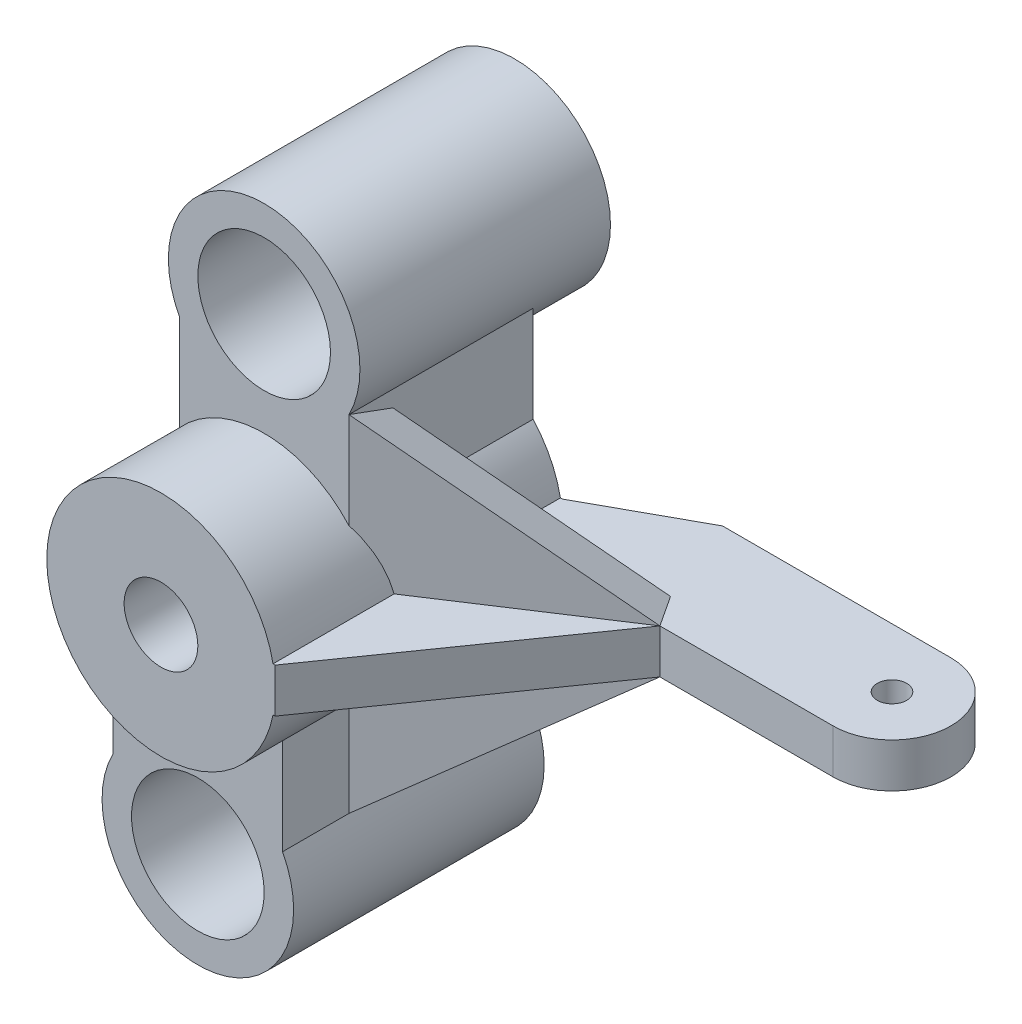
ISO-10303-21;
HEADER;
FILE_DESCRIPTION(('STEP AP214'),'2;1');
FILE_NAME('part.step','',(''),(''),'','','');
FILE_SCHEMA(('AUTOMOTIVE_DESIGN { 1 0 10303 214 1 1 1 1 }'));
ENDSEC;
DATA;
#1=APPLICATION_CONTEXT('core data for automotive mechanical design processes');
#2=APPLICATION_PROTOCOL_DEFINITION('international standard','automotive_design',2000,#1);
#3=PRODUCT_CONTEXT('',#1,'mechanical');
#4=PRODUCT('Part','Part','',(#3));
#5=PRODUCT_RELATED_PRODUCT_CATEGORY('part','',(#4));
#6=PRODUCT_DEFINITION_FORMATION('','',#4);
#7=PRODUCT_DEFINITION_CONTEXT('part definition',#1,'design');
#8=PRODUCT_DEFINITION('design','',#6,#7);
#9=PRODUCT_DEFINITION_SHAPE('','',#8);
#10=(LENGTH_UNIT() NAMED_UNIT(*) SI_UNIT(.MILLI.,.METRE.));
#11=(NAMED_UNIT(*) PLANE_ANGLE_UNIT() SI_UNIT($,.RADIAN.));
#12=(NAMED_UNIT(*) SI_UNIT($,.STERADIAN.) SOLID_ANGLE_UNIT());
#13=UNCERTAINTY_MEASURE_WITH_UNIT(LENGTH_MEASURE(1.E-05),#10,'distance_accuracy_value','');
#14=(GEOMETRIC_REPRESENTATION_CONTEXT(3) GLOBAL_UNCERTAINTY_ASSIGNED_CONTEXT((#13)) GLOBAL_UNIT_ASSIGNED_CONTEXT((#10,
#11,#12)) REPRESENTATION_CONTEXT('',''));
#15=CARTESIAN_POINT('',(0.,0.,0.));
#16=DIRECTION('',(0.,0.,1.));
#17=DIRECTION('',(1.,0.,0.));
#18=AXIS2_PLACEMENT_3D('',#15,#16,#17);
#19=CARTESIAN_POINT('',(0.,0.,7.));
#20=DIRECTION('',(0.,0.,-1.));
#21=DIRECTION('',(-1.,0.,0.));
#22=AXIS2_PLACEMENT_3D('',#19,#20,#21);
#23=CYLINDRICAL_SURFACE('',#22,7.75);
#24=DIRECTION('',(0.,0.,-1.));
#25=VECTOR('',#24,1.);
#26=CARTESIAN_POINT('',(7.60345316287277,-1.5,7.));
#27=LINE('',#26,#25);
#28=CARTESIAN_POINT('',(7.60345316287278,-1.5,-4.20293475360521));
#29=VERTEX_POINT('',#28);
#30=CARTESIAN_POINT('',(7.60345316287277,-1.5,-12.5));
#31=VERTEX_POINT('',#30);
#32=EDGE_CURVE('E713',#29,#31,#27,.T.);
#33=ORIENTED_EDGE('',*,*,#32,.F.);
#34=CARTESIAN_POINT('',(0.,0.,0.778216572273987));
#35=DIRECTION('',(0.547993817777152,0.,0.83648238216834));
#36=DIRECTION('',(0.83648238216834,0.,-0.547993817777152));
#37=AXIS2_PLACEMENT_3D('',#34,#35,#36);
#38=ELLIPSE('',#37,9.26498891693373,7.75);
#39=CARTESIAN_POINT('',(5.75,-5.19615242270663,-2.98870610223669));
#40=VERTEX_POINT('',#39);
#41=EDGE_CURVE('E366',#29,#40,#38,.F.);
#42=ORIENTED_EDGE('',*,*,#41,.T.);
#43=DIRECTION('',(0.,0.,-1.));
#44=VECTOR('',#43,1.);
#45=CARTESIAN_POINT('',(5.75,-5.19615242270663,7.));
#46=LINE('',#45,#44);
#47=CARTESIAN_POINT('',(5.75,-5.19615242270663,-12.5));
#48=VERTEX_POINT('',#47);
#49=EDGE_CURVE('E624',#40,#48,#46,.T.);
#50=ORIENTED_EDGE('',*,*,#49,.T.);
#51=CARTESIAN_POINT('',(0.,0.,-12.5));
#52=DIRECTION('',(0.,0.,-1.));
#53=DIRECTION('',(-1.,0.,0.));
#54=AXIS2_PLACEMENT_3D('',#51,#52,#53);
#55=CIRCLE('',#54,7.75);
#56=EDGE_CURVE('E819',#31,#48,#55,.T.);
#57=ORIENTED_EDGE('',*,*,#56,.F.);
#58=EDGE_LOOP('',(#33,#42,#50,#57));
#59=FACE_BOUND('',#58,.T.);
#60=ADVANCED_FACE('F350',(#59),#23,.T.);
#61=CARTESIAN_POINT('',(5.75,14.75,-12.5));
#62=DIRECTION('',(1.,0.,0.));
#63=DIRECTION('',(0.,1.,0.));
#64=AXIS2_PLACEMENT_3D('',#61,#62,#63);
#65=PLANE('',#64);
#66=DIRECTION('',(0.,-1.,0.));
#67=VECTOR('',#66,1.);
#68=CARTESIAN_POINT('',(5.75,14.75,0.));
#69=LINE('',#68,#67);
#70=CARTESIAN_POINT('',(5.75,-5.19615242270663,0.));
#71=VERTEX_POINT('',#70);
#72=CARTESIAN_POINT('',(5.75,-11.7189110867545,0.));
#73=VERTEX_POINT('',#72);
#74=EDGE_CURVE('E615',#71,#73,#69,.T.);
#75=ORIENTED_EDGE('',*,*,#74,.F.);
#76=CARTESIAN_POINT('',(5.75,-5.19615242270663,4.5));
#77=VERTEX_POINT('',#76);
#78=EDGE_CURVE('E823',#77,#71,#46,.T.);
#79=ORIENTED_EDGE('',*,*,#78,.F.);
#80=DIRECTION('',(0.,1.,0.));
#81=VECTOR('',#80,1.);
#82=CARTESIAN_POINT('',(5.75,0.,4.5));
#83=LINE('',#82,#81);
#84=CARTESIAN_POINT('',(5.75,-11.7189110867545,4.5));
#85=VERTEX_POINT('',#84);
#86=EDGE_CURVE('E863',#85,#77,#83,.T.);
#87=ORIENTED_EDGE('',*,*,#86,.F.);
#88=DIRECTION('',(0.,0.,1.));
#89=VECTOR('',#88,1.);
#90=CARTESIAN_POINT('',(5.75,-11.7189110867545,-12.5));
#91=LINE('',#90,#89);
#92=EDGE_CURVE('E854',#73,#85,#91,.T.);
#93=ORIENTED_EDGE('',*,*,#92,.F.);
#94=EDGE_LOOP('',(#75,#79,#87,#93));
#95=FACE_BOUND('',#94,.T.);
#96=ADVANCED_FACE('F1031',(#95),#65,.T.);
#97=CARTESIAN_POINT('',(30.25,-1.5,-12.3528691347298));
#98=DIRECTION('',(0.,-1.,0.));
#99=DIRECTION('',(0.,0.,-1.));
#100=AXIS2_PLACEMENT_3D('',#97,#98,#99);
#101=PLANE('',#100);
#102=DIRECTION('',(-0.83648238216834,0.,0.547993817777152));
#103=VECTOR('',#102,1.);
#104=CARTESIAN_POINT('',(28.5551147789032,-1.5,-14.940018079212));
#105=LINE('',#104,#103);
#106=CARTESIAN_POINT('',(18.5001947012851,-1.5,-8.35286913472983));
#107=VERTEX_POINT('',#106);
#108=CARTESIAN_POINT('',(7.60345316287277,-1.5,-1.21422865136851));
#109=VERTEX_POINT('',#108);
#110=EDGE_CURVE('E625',#107,#109,#105,.T.);
#111=ORIENTED_EDGE('',*,*,#110,.F.);
#112=DIRECTION('',(0.573576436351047,0.,-0.819152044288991));
#113=VECTOR('',#112,1.);
#114=CARTESIAN_POINT('',(7.75,-1.5,7.));
#115=LINE('',#114,#113);
#116=CARTESIAN_POINT('',(7.75,-1.5,7.));
#117=VERTEX_POINT('',#116);
#118=EDGE_CURVE('E659',#117,#107,#115,.T.);
#119=ORIENTED_EDGE('',*,*,#118,.F.);
#120=DIRECTION('',(1.,0.,0.));
#121=VECTOR('',#120,1.);
#122=CARTESIAN_POINT('',(7.75,-1.5,7.));
#123=LINE('',#122,#121);
#124=CARTESIAN_POINT('',(7.60345316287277,-1.5,7.));
#125=VERTEX_POINT('',#124);
#126=EDGE_CURVE('E677',#125,#117,#123,.T.);
#127=ORIENTED_EDGE('',*,*,#126,.F.);
#128=EDGE_CURVE('E714',#125,#109,#27,.T.);
#129=ORIENTED_EDGE('',*,*,#128,.T.);
#130=EDGE_LOOP('',(#111,#119,#127,#129));
#131=FACE_BOUND('',#130,.T.);
#132=ADVANCED_FACE('F1045',(#131),#101,.T.);
#133=DIRECTION('',(0.,0.,-1.));
#134=VECTOR('',#133,1.);
#135=CARTESIAN_POINT('',(5.75,5.19615242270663,7.));
#136=LINE('',#135,#134);
#137=CARTESIAN_POINT('',(5.75,5.19615242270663,-12.5));
#138=VERTEX_POINT('',#137);
#139=CARTESIAN_POINT('',(5.75,5.19615242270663,-2.98870610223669));
#140=VERTEX_POINT('',#139);
#141=EDGE_CURVE('E831',#138,#140,#136,.F.);
#142=ORIENTED_EDGE('',*,*,#141,.T.);
#143=CARTESIAN_POINT('',(0.,0.,0.778216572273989));
#144=DIRECTION('',(0.547993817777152,0.,0.83648238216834));
#145=DIRECTION('',(0.83648238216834,0.,-0.547993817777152));
#146=AXIS2_PLACEMENT_3D('',#143,#144,#145);
#147=ELLIPSE('',#146,9.26498891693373,7.75);
#148=CARTESIAN_POINT('',(7.60345316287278,1.5,-4.20293475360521));
#149=VERTEX_POINT('',#148);
#150=EDGE_CURVE('E640',#140,#149,#147,.F.);
#151=ORIENTED_EDGE('',*,*,#150,.T.);
#152=DIRECTION('',(0.,0.,-1.));
#153=VECTOR('',#152,1.);
#154=CARTESIAN_POINT('',(7.60345316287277,1.5,7.));
#155=LINE('',#154,#153);
#156=CARTESIAN_POINT('',(7.60345316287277,1.5,-12.5));
#157=VERTEX_POINT('',#156);
#158=EDGE_CURVE('E717',#149,#157,#155,.T.);
#159=ORIENTED_EDGE('',*,*,#158,.T.);
#160=EDGE_CURVE('E820',#138,#157,#55,.T.);
#161=ORIENTED_EDGE('',*,*,#160,.F.);
#162=EDGE_LOOP('',(#142,#151,#159,#161));
#163=FACE_BOUND('',#162,.T.);
#164=ADVANCED_FACE('F1004',(#163),#23,.T.);
#165=CARTESIAN_POINT('',(30.25,1.5,-12.3528691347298));
#166=DIRECTION('',(0.,-1.,0.));
#167=DIRECTION('',(0.,0.,-1.));
#168=AXIS2_PLACEMENT_3D('',#165,#166,#167);
#169=PLANE('',#168);
#170=DIRECTION('',(0.573576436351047,0.,-0.819152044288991));
#171=VECTOR('',#170,1.);
#172=CARTESIAN_POINT('',(7.75,1.5,7.));
#173=LINE('',#172,#171);
#174=CARTESIAN_POINT('',(7.75,1.5,7.));
#175=VERTEX_POINT('',#174);
#176=CARTESIAN_POINT('',(18.500194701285,1.5,-8.35286913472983));
#177=VERTEX_POINT('',#176);
#178=EDGE_CURVE('E680',#175,#177,#173,.T.);
#179=ORIENTED_EDGE('',*,*,#178,.T.);
#180=DIRECTION('',(-0.83648238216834,0.,0.547993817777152));
#181=VECTOR('',#180,1.);
#182=CARTESIAN_POINT('',(28.5551147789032,1.5,-14.940018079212));
#183=LINE('',#182,#181);
#184=CARTESIAN_POINT('',(7.60345316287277,1.5,-1.21422865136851));
#185=VERTEX_POINT('',#184);
#186=EDGE_CURVE('E650',#177,#185,#183,.T.);
#187=ORIENTED_EDGE('',*,*,#186,.T.);
#188=CARTESIAN_POINT('',(7.60345316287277,1.5,7.));
#189=VERTEX_POINT('',#188);
#190=EDGE_CURVE('E718',#189,#185,#155,.T.);
#191=ORIENTED_EDGE('',*,*,#190,.F.);
#192=DIRECTION('',(1.,0.,0.));
#193=VECTOR('',#192,1.);
#194=CARTESIAN_POINT('',(7.75,1.5,7.));
#195=LINE('',#194,#193);
#196=EDGE_CURVE('E695',#189,#175,#195,.T.);
#197=ORIENTED_EDGE('',*,*,#196,.T.);
#198=EDGE_LOOP('',(#179,#187,#191,#197));
#199=FACE_BOUND('',#198,.T.);
#200=ADVANCED_FACE('F1027',(#199),#169,.F.);
#201=CARTESIAN_POINT('',(-5.75,-14.75,-12.5));
#202=DIRECTION('',(0.,0.,1.));
#203=DIRECTION('',(1.,0.,0.));
#204=AXIS2_PLACEMENT_3D('',#201,#202,#203);
#205=PLANE('',#204);
#206=CARTESIAN_POINT('',(0.,0.,-12.5));
#207=DIRECTION('',(0.,0.,-1.));
#208=DIRECTION('',(-1.,0.,0.));
#209=AXIS2_PLACEMENT_3D('',#206,#207,#208);
#210=CIRCLE('',#209,7.25);
#211=CARTESIAN_POINT('',(7.23519163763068,-0.463143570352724,-12.5));
#212=VERTEX_POINT('',#211);
#213=CARTESIAN_POINT('',(7.23519163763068,0.463143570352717,-12.5));
#214=VERTEX_POINT('',#213);
#215=EDGE_CURVE('E721',#212,#214,#210,.T.);
#216=ORIENTED_EDGE('',*,*,#215,.F.);
#217=DIRECTION('',(0.,-1.,0.));
#218=VECTOR('',#217,1.);
#219=CARTESIAN_POINT('',(7.23519163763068,1.5,-12.5));
#220=LINE('',#219,#218);
#221=EDGE_CURVE('E699',#214,#212,#220,.T.);
#222=ORIENTED_EDGE('',*,*,#221,.F.);
#223=EDGE_LOOP('',(#216,#222));
#224=FACE_BOUND('',#223,.T.);
#225=ORIENTED_EDGE('',*,*,#160,.T.);
#226=DIRECTION('',(-1.,0.,0.));
#227=VECTOR('',#226,1.);
#228=CARTESIAN_POINT('',(7.23519163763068,1.5,-12.5));
#229=LINE('',#228,#227);
#230=CARTESIAN_POINT('',(7.73519163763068,1.5,-12.5));
#231=VERTEX_POINT('',#230);
#232=EDGE_CURVE('E692',#231,#157,#229,.T.);
#233=ORIENTED_EDGE('',*,*,#232,.F.);
#234=DIRECTION('',(0.,-1.,0.));
#235=VECTOR('',#234,1.);
#236=CARTESIAN_POINT('',(7.73519163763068,1.5,-12.5));
#237=LINE('',#236,#235);
#238=CARTESIAN_POINT('',(7.73519163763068,-1.5,-12.5));
#239=VERTEX_POINT('',#238);
#240=EDGE_CURVE('E702',#231,#239,#237,.T.);
#241=ORIENTED_EDGE('',*,*,#240,.T.);
#242=DIRECTION('',(-1.,0.,0.));
#243=VECTOR('',#242,1.);
#244=CARTESIAN_POINT('',(7.23519163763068,-1.5,-12.5));
#245=LINE('',#244,#243);
#246=EDGE_CURVE('E674',#239,#31,#245,.T.);
#247=ORIENTED_EDGE('',*,*,#246,.T.);
#248=ORIENTED_EDGE('',*,*,#56,.T.);
#249=DIRECTION('',(0.,1.,0.));
#250=VECTOR('',#249,1.);
#251=CARTESIAN_POINT('',(5.75,14.75,-12.5));
#252=LINE('',#251,#250);
#253=CARTESIAN_POINT('',(5.75,-11.7189110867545,-12.5));
#254=VERTEX_POINT('',#253);
#255=EDGE_CURVE('E876',#254,#48,#252,.T.);
#256=ORIENTED_EDGE('',*,*,#255,.F.);
#257=CARTESIAN_POINT('',(0.,-14.75,-12.5));
#258=DIRECTION('',(0.,0.,1.));
#259=DIRECTION('',(1.,0.,0.));
#260=AXIS2_PLACEMENT_3D('',#257,#258,#259);
#261=CIRCLE('',#260,6.5);
#262=CARTESIAN_POINT('',(-5.75,-11.7189110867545,-12.5));
#263=VERTEX_POINT('',#262);
#264=EDGE_CURVE('E852',#263,#254,#261,.T.);
#265=ORIENTED_EDGE('',*,*,#264,.F.);
#266=DIRECTION('',(0.,-1.,0.));
#267=VECTOR('',#266,1.);
#268=CARTESIAN_POINT('',(-5.75,14.75,-12.5));
#269=LINE('',#268,#267);
#270=CARTESIAN_POINT('',(-5.75,-5.19615242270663,-12.5));
#271=VERTEX_POINT('',#270);
#272=EDGE_CURVE('E881',#271,#263,#269,.T.);
#273=ORIENTED_EDGE('',*,*,#272,.F.);
#274=CARTESIAN_POINT('',(-5.75,5.19615242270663,-12.5));
#275=VERTEX_POINT('',#274);
#276=EDGE_CURVE('E816',#271,#275,#55,.T.);
#277=ORIENTED_EDGE('',*,*,#276,.T.);
#278=CARTESIAN_POINT('',(-5.75,11.7189110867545,-12.5));
#279=VERTEX_POINT('',#278);
#280=EDGE_CURVE('E1109',#279,#275,#269,.T.);
#281=ORIENTED_EDGE('',*,*,#280,.F.);
#282=CARTESIAN_POINT('',(0.,14.75,-12.5));
#283=DIRECTION('',(0.,0.,1.));
#284=DIRECTION('',(1.,0.,0.));
#285=AXIS2_PLACEMENT_3D('',#282,#283,#284);
#286=CIRCLE('',#285,6.5);
#287=CARTESIAN_POINT('',(5.75,11.7189110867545,-12.5));
#288=VERTEX_POINT('',#287);
#289=EDGE_CURVE('E842',#279,#288,#286,.T.);
#290=ORIENTED_EDGE('',*,*,#289,.T.);
#291=EDGE_CURVE('E1107',#138,#288,#252,.T.);
#292=ORIENTED_EDGE('',*,*,#291,.F.);
#293=EDGE_LOOP('',(#225,#233,#241,#247,#248,#256,#265,#273,#277,#281,#290,#292));
#294=FACE_BOUND('',#293,.T.);
#295=DIRECTION('',(-1.,0.,0.));
#296=VECTOR('',#295,1.);
#297=CARTESIAN_POINT('',(4.5,-18.25,-12.5000000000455));
#298=LINE('',#297,#296);
#299=CARTESIAN_POINT('',(4.5,-18.2499999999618,-12.5));
#300=VERTEX_POINT('',#299);
#301=CARTESIAN_POINT('',(-4.5,-18.25,-12.5000000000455));
#302=VERTEX_POINT('',#301);
#303=EDGE_CURVE('E730',#300,#302,#298,.T.);
#304=ORIENTED_EDGE('',*,*,#303,.F.);
#305=DIRECTION('',(0.,-1.,0.));
#306=VECTOR('',#305,1.);
#307=CARTESIAN_POINT('',(4.5,-11.25,-12.5000000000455));
#308=LINE('',#307,#306);
#309=CARTESIAN_POINT('',(4.5,-11.25,-12.5000000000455));
#310=VERTEX_POINT('',#309);
#311=EDGE_CURVE('E727',#310,#300,#308,.T.);
#312=ORIENTED_EDGE('',*,*,#311,.F.);
#313=DIRECTION('',(1.,0.,0.));
#314=VECTOR('',#313,1.);
#315=CARTESIAN_POINT('',(4.5,-11.25,-12.5000000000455));
#316=LINE('',#315,#314);
#317=CARTESIAN_POINT('',(-4.5,-11.25,-12.5000000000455));
#318=VERTEX_POINT('',#317);
#319=EDGE_CURVE('E736',#318,#310,#316,.T.);
#320=ORIENTED_EDGE('',*,*,#319,.F.);
#321=DIRECTION('',(0.,1.,0.));
#322=VECTOR('',#321,1.);
#323=CARTESIAN_POINT('',(-4.5,-11.25,-12.5000000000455));
#324=LINE('',#323,#322);
#325=EDGE_CURVE('E733',#302,#318,#324,.T.);
#326=ORIENTED_EDGE('',*,*,#325,.F.);
#327=EDGE_LOOP('',(#304,#312,#320,#326));
#328=FACE_BOUND('',#327,.T.);
#329=ADVANCED_FACE('F1002',(#224,#294,#328),#205,.F.);
#330=CARTESIAN_POINT('',(0.,0.,3.76692267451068));
#331=DIRECTION('',(0.547993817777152,0.,0.83648238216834));
#332=DIRECTION('',(0.83648238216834,0.,-0.547993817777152));
#333=AXIS2_PLACEMENT_3D('',#330,#331,#332);
#334=ELLIPSE('',#333,9.26498891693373,7.75);
#335=CARTESIAN_POINT('',(5.75,5.19615242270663,0.));
#336=VERTEX_POINT('',#335);
#337=EDGE_CURVE('E647',#336,#185,#334,.F.);
#338=ORIENTED_EDGE('',*,*,#337,.F.);
#339=CARTESIAN_POINT('',(0.,0.,0.));
#340=DIRECTION('',(0.,0.,1.));
#341=DIRECTION('',(1.,0.,0.));
#342=AXIS2_PLACEMENT_3D('',#339,#340,#341);
#343=CIRCLE('',#342,7.75);
#344=CARTESIAN_POINT('',(-5.75,5.19615242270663,0.));
#345=VERTEX_POINT('',#344);
#346=EDGE_CURVE('E829',#336,#345,#343,.T.);
#347=ORIENTED_EDGE('',*,*,#346,.T.);
#348=DIRECTION('',(0.,0.,-1.));
#349=VECTOR('',#348,1.);
#350=CARTESIAN_POINT('',(-5.75,5.19615242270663,7.));
#351=LINE('',#350,#349);
#352=EDGE_CURVE('E834',#345,#275,#351,.T.);
#353=ORIENTED_EDGE('',*,*,#352,.T.);
#354=ORIENTED_EDGE('',*,*,#276,.F.);
#355=DIRECTION('',(0.,0.,-1.));
#356=VECTOR('',#355,1.);
#357=CARTESIAN_POINT('',(-5.75,-5.19615242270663,7.));
#358=LINE('',#357,#356);
#359=CARTESIAN_POINT('',(-5.75,-5.19615242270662,4.5));
#360=VERTEX_POINT('',#359);
#361=EDGE_CURVE('E826',#271,#360,#358,.F.);
#362=ORIENTED_EDGE('',*,*,#361,.T.);
#363=CARTESIAN_POINT('',(0.,0.,4.5));
#364=DIRECTION('',(0.,0.,1.));
#365=DIRECTION('',(1.,0.,0.));
#366=AXIS2_PLACEMENT_3D('',#363,#364,#365);
#367=CIRCLE('',#366,7.75);
#368=EDGE_CURVE('E877',#360,#77,#367,.T.);
#369=ORIENTED_EDGE('',*,*,#368,.T.);
#370=ORIENTED_EDGE('',*,*,#78,.T.);
#371=CARTESIAN_POINT('',(0.,0.,3.76692267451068));
#372=DIRECTION('',(0.547993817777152,0.,0.83648238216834));
#373=DIRECTION('',(0.83648238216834,0.,-0.547993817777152));
#374=AXIS2_PLACEMENT_3D('',#371,#372,#373);
#375=ELLIPSE('',#374,9.26498891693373,7.75);
#376=EDGE_CURVE('E627',#109,#71,#375,.F.);
#377=ORIENTED_EDGE('',*,*,#376,.F.);
#378=ORIENTED_EDGE('',*,*,#128,.F.);
#379=CARTESIAN_POINT('',(0.,0.,7.));
#380=DIRECTION('',(0.,0.,-1.));
#381=DIRECTION('',(-1.,0.,0.));
#382=AXIS2_PLACEMENT_3D('',#379,#380,#381);
#383=CIRCLE('',#382,7.75);
#384=EDGE_CURVE('E821',#125,#189,#383,.T.);
#385=ORIENTED_EDGE('',*,*,#384,.T.);
#386=ORIENTED_EDGE('',*,*,#190,.T.);
#387=EDGE_LOOP('',(#338,#347,#353,#354,#362,#369,#370,#377,#378,#385,#386));
#388=FACE_BOUND('',#387,.T.);
#389=ADVANCED_FACE('F999',(#388),#23,.T.);
#390=CARTESIAN_POINT('',(0.,0.,-12.5));
#391=DIRECTION('',(0.,0.,-1.));
#392=DIRECTION('',(-1.,0.,0.));
#393=AXIS2_PLACEMENT_3D('',#390,#391,#392);
#394=CONICAL_SURFACE('',#393,7.25,0.218166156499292);
#395=CARTESIAN_POINT('',(0.,0.,-2.5));
#396=DIRECTION('',(0.,0.,-1.));
#397=DIRECTION('',(-1.,0.,0.));
#398=AXIS2_PLACEMENT_3D('',#395,#396,#397);
#399=CIRCLE('',#398,5.0330533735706);
#400=CARTESIAN_POINT('',(-5.03305337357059,0.,-2.5));
#401=VERTEX_POINT('',#400);
#402=EDGE_CURVE('E723',#401,#401,#399,.T.);
#403=ORIENTED_EDGE('',*,*,#402,.F.);
#404=EDGE_LOOP('',(#403));
#405=FACE_BOUND('',#404,.T.);
#406=CARTESIAN_POINT('',(7.23519163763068,-6.16577720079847,-22.6763411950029));
#407=CARTESIAN_POINT('',(7.23519163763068,-6.05568096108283,-22.354311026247));
#408=CARTESIAN_POINT('',(7.23519163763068,-5.94410119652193,-22.0327807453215));
#409=CARTESIAN_POINT('',(7.23519163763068,-5.71735114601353,-21.3909438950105));
#410=CARTESIAN_POINT('',(7.23519163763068,-5.60218040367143,-21.0706374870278));
#411=CARTESIAN_POINT('',(7.23519163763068,-5.36734110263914,-20.4307055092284));
#412=CARTESIAN_POINT('',(7.23519163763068,-5.24766140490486,-20.1110840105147));
#413=CARTESIAN_POINT('',(7.23519163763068,-5.00324840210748,-19.473798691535));
#414=CARTESIAN_POINT('',(7.23519163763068,-4.87851535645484,-19.1561347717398));
#415=CARTESIAN_POINT('',(7.23519163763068,-4.57847466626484,-18.4132300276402));
#416=CARTESIAN_POINT('',(7.23519163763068,-4.40066140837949,-17.9889873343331));
#417=CARTESIAN_POINT('',(7.23519163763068,-4.12270297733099,-17.3578728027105));
#418=CARTESIAN_POINT('',(7.23519163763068,-4.02823736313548,-17.1485007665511));
#419=CARTESIAN_POINT('',(7.23519163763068,-3.83478293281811,-16.7318680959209));
#420=CARTESIAN_POINT('',(7.23519163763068,-3.73579432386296,-16.5246073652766));
#421=CARTESIAN_POINT('',(7.23519163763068,-3.49527939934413,-16.0376110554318));
#422=CARTESIAN_POINT('',(7.23519163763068,-3.35140715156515,-15.759014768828));
#423=CARTESIAN_POINT('',(7.23519163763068,-3.12525629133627,-15.3463550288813));
#424=CARTESIAN_POINT('',(7.23519163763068,-3.04804859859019,-15.2095108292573));
#425=CARTESIAN_POINT('',(7.23519163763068,-2.88959949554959,-14.9381846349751));
#426=CARTESIAN_POINT('',(7.23519163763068,-2.80835849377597,-14.8037024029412));
#427=CARTESIAN_POINT('',(7.23519163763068,-2.63769266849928,-14.5323917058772));
#428=CARTESIAN_POINT('',(7.23519163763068,-2.54807000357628,-14.3956869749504));
#429=CARTESIAN_POINT('',(7.23519163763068,-2.36248691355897,-14.1266746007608));
#430=CARTESIAN_POINT('',(7.23519163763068,-2.26652850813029,-13.9943655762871));
#431=CARTESIAN_POINT('',(7.23519163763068,-2.06700218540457,-13.7361741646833));
#432=CARTESIAN_POINT('',(7.23519163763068,-1.96345729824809,-13.6102741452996));
#433=CARTESIAN_POINT('',(7.23519163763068,-1.74657648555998,-13.3673032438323));
#434=CARTESIAN_POINT('',(7.23519163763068,-1.63325315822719,-13.2502213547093));
#435=CARTESIAN_POINT('',(7.23519163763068,-1.41783989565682,-13.0512528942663));
#436=CARTESIAN_POINT('',(7.23519163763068,-1.31797235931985,-12.9669890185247));
#437=CARTESIAN_POINT('',(7.23519163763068,-1.10873981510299,-12.810903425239));
#438=CARTESIAN_POINT('',(7.23519163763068,-0.999379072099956,-12.7390761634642));
#439=CARTESIAN_POINT('',(7.23519163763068,-0.791204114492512,-12.6250833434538));
#440=CARTESIAN_POINT('',(7.23519163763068,-0.694069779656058,-12.5799013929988));
#441=CARTESIAN_POINT('',(7.23519163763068,-0.493779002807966,-12.5060529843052));
#442=CARTESIAN_POINT('',(7.23519163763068,-0.390642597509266,-12.4773346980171));
#443=CARTESIAN_POINT('',(7.23519163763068,-0.238656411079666,-12.450256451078));
#444=CARTESIAN_POINT('',(7.23519163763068,-0.191164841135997,-12.4438870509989));
#445=CARTESIAN_POINT('',(7.23519163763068,-0.0957931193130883,-12.4353535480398));
#446=CARTESIAN_POINT('',(7.23519163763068,-0.0479128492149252,-12.4331907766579));
#447=CARTESIAN_POINT('',(7.23519163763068,0.112153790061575,-12.4332342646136));
#448=CARTESIAN_POINT('',(7.23519163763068,0.224486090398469,-12.4451865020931));
#449=CARTESIAN_POINT('',(7.23519163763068,0.444625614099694,-12.4909638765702));
#450=CARTESIAN_POINT('',(7.23519163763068,0.552418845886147,-12.5248520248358));
#451=CARTESIAN_POINT('',(7.23519163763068,0.789482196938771,-12.6214831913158));
#452=CARTESIAN_POINT('',(7.23519163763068,0.916508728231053,-12.6895979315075));
#453=CARTESIAN_POINT('',(7.23519163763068,1.15851566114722,-12.8444852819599));
#454=CARTESIAN_POINT('',(7.23519163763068,1.27346345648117,-12.9313065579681));
#455=CARTESIAN_POINT('',(7.23519163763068,1.51781142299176,-13.1382567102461));
#456=CARTESIAN_POINT('',(7.23519163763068,1.64455114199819,-13.2614696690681));
#457=CARTESIAN_POINT('',(7.23519163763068,1.88583588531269,-13.5194425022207));
#458=CARTESIAN_POINT('',(7.23519163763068,2.00035717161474,-13.6542239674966));
#459=CARTESIAN_POINT('',(7.23519163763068,2.22112827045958,-13.9330456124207));
#460=CARTESIAN_POINT('',(7.23519163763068,2.32725784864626,-14.0771799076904));
#461=CARTESIAN_POINT('',(7.23519163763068,2.53164127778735,-14.3706557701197));
#462=CARTESIAN_POINT('',(7.23519163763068,2.62990289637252,-14.5199919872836));
#463=CARTESIAN_POINT('',(7.23519163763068,2.82734754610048,-14.8339070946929));
#464=CARTESIAN_POINT('',(7.23519163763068,2.92604620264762,-14.9987887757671));
#465=CARTESIAN_POINT('',(7.23519163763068,3.11765818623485,-15.3318951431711));
#466=CARTESIAN_POINT('',(7.23519163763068,3.2105705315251,-15.5001203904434));
#467=CARTESIAN_POINT('',(7.23519163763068,3.39168139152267,-15.8392255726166));
#468=CARTESIAN_POINT('',(7.23519163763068,3.47987667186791,-16.0101072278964));
#469=CARTESIAN_POINT('',(7.23519163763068,3.65226298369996,-16.3538833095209));
#470=CARTESIAN_POINT('',(7.23519163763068,3.73645376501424,-16.5267778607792));
#471=CARTESIAN_POINT('',(7.23519163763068,3.9845819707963,-17.049190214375));
#472=CARTESIAN_POINT('',(7.23519163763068,4.14339688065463,-17.4011412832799));
#473=CARTESIAN_POINT('',(7.23519163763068,4.4508074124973,-18.1092704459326));
#474=CARTESIAN_POINT('',(7.23519163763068,4.59940685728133,-18.4654468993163));
#475=CARTESIAN_POINT('',(7.23519163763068,4.87287128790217,-19.1418321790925));
#476=CARTESIAN_POINT('',(7.23519163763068,4.99855405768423,-19.461711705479));
#477=CARTESIAN_POINT('',(7.23519163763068,5.24479879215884,-20.1034714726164));
#478=CARTESIAN_POINT('',(7.23519163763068,5.36536017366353,-20.4253519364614));
#479=CARTESIAN_POINT('',(7.23519163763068,5.60125557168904,-21.0680736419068));
#480=CARTESIAN_POINT('',(7.23519163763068,5.7166239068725,-21.3889023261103));
#481=CARTESIAN_POINT('',(7.23519163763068,5.94374922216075,-22.0317677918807));
#482=CARTESIAN_POINT('',(7.23519163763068,6.05550688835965,-22.3538043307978));
#483=CARTESIAN_POINT('',(7.23519163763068,6.16577720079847,-22.6763411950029));
#484=B_SPLINE_CURVE_WITH_KNOTS('',3,(#406,#407,#408,#409,#410,#411,#412,#413,#414,#415,#416,
#417,#418,#419,#420,#421,#422,#423,#424,#425,#426,#427,#428,#429,#430,#431,#432,#433,#434,#435,
#436,#437,#438,#439,#440,#441,#442,#443,#444,#445,#446,#447,#448,#449,#450,#451,#452,#453,#454,
#455,#456,#457,#458,#459,#460,#461,#462,#463,#464,#465,#466,#467,#468,#469,#470,#471,#472,#473,
#474,#475,#476,#477,#478,#479,#480,#481,#482,#483),.UNSPECIFIED.,.F.,.F.,(4,2,2,2,2,2,2,2,2,2,2,
2,2,2,2,2,2,2,2,2,2,2,2,2,2,2,2,2,2,2,2,2,2,2,2,2,2,2,4),(0.,1.02099674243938,2.04212378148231,
3.06596432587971,4.08975237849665,5.46949842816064,6.15854173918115,6.84755352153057,
7.78788230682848,8.25919572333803,8.73046149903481,9.2207124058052,9.7108077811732,
10.1994725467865,10.6875168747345,11.0788721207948,11.4700524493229,11.790347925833,
12.1096294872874,12.2532139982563,12.396843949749,12.7330511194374,13.0702283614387,
13.500110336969,13.9311244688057,14.4601840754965,14.9902535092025,15.5268986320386,
16.0630072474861,16.639353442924,17.2157971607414,17.792631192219,18.3695012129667,
19.5276247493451,20.685312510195,21.7163130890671,22.7474307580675,23.770231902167,
24.7928375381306),.UNSPECIFIED.);
#485=EDGE_CURVE('E359',#212,#214,#484,.T.);
#486=ORIENTED_EDGE('',*,*,#485,.F.);
#487=ORIENTED_EDGE('',*,*,#215,.T.);
#488=EDGE_LOOP('',(#486,#487));
#489=FACE_BOUND('',#488,.T.);
#490=ADVANCED_FACE('F352',(#405,#489),#394,.F.);
#491=CARTESIAN_POINT('',(0.,0.,-17.));
#492=DIRECTION('',(0.,0.,1.));
#493=DIRECTION('',(1.,0.,0.));
#494=AXIS2_PLACEMENT_3D('',#491,#492,#493);
#495=CYLINDRICAL_SURFACE('',#494,2.5);
#496=CARTESIAN_POINT('',(0.,0.,7.));
#497=DIRECTION('',(0.,0.,1.));
#498=DIRECTION('',(1.,0.,0.));
#499=AXIS2_PLACEMENT_3D('',#496,#497,#498);
#500=CIRCLE('',#499,2.5);
#501=CARTESIAN_POINT('',(2.5,0.,7.));
#502=VERTEX_POINT('',#501);
#503=EDGE_CURVE('E724',#502,#502,#500,.T.);
#504=ORIENTED_EDGE('',*,*,#503,.T.);
#505=EDGE_LOOP('',(#504));
#506=FACE_BOUND('',#505,.T.);
#507=CARTESIAN_POINT('',(0.,0.,-2.5));
#508=DIRECTION('',(0.,0.,-1.));
#509=DIRECTION('',(-1.,0.,0.));
#510=AXIS2_PLACEMENT_3D('',#507,#508,#509);
#511=CIRCLE('',#510,2.5);
#512=CARTESIAN_POINT('',(-2.5,0.,-2.5));
#513=VERTEX_POINT('',#512);
#514=EDGE_CURVE('E728',#513,#513,#511,.F.);
#515=ORIENTED_EDGE('',*,*,#514,.F.);
#516=EDGE_LOOP('',(#515));
#517=FACE_BOUND('',#516,.T.);
#518=ADVANCED_FACE('F939',(#506,#517),#495,.F.);
#519=CARTESIAN_POINT('',(0.,-14.75,-12.0000000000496));
#520=DIRECTION('',(0.,0.,1.));
#521=DIRECTION('',(1.,0.,0.));
#522=AXIS2_PLACEMENT_3D('',#519,#520,#521);
#523=PLANE('',#522);
#524=DIRECTION('',(0.,1.,0.));
#525=VECTOR('',#524,1.);
#526=CARTESIAN_POINT('',(4.08045018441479,-14.75,-12.0000000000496));
#527=LINE('',#526,#525);
#528=CARTESIAN_POINT('',(4.08045018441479,-16.6473471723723,-12.0000000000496));
#529=VERTEX_POINT('',#528);
#530=CARTESIAN_POINT('',(4.08045018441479,-12.8526528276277,-12.0000000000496));
#531=VERTEX_POINT('',#530);
#532=EDGE_CURVE('E895',#529,#531,#527,.T.);
#533=ORIENTED_EDGE('',*,*,#532,.F.);
#534=CARTESIAN_POINT('',(0.,-14.75,-12.0000000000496));
#535=DIRECTION('',(0.,0.,1.));
#536=DIRECTION('',(1.,0.,0.));
#537=AXIS2_PLACEMENT_3D('',#534,#535,#536);
#538=CIRCLE('',#537,4.5);
#539=EDGE_CURVE('E767',#529,#531,#538,.T.);
#540=ORIENTED_EDGE('',*,*,#539,.T.);
#541=EDGE_LOOP('',(#533,#540));
#542=FACE_BOUND('',#541,.T.);
#543=ADVANCED_FACE('F942',(#542),#523,.T.);
#544=DIRECTION('',(-1.,0.,0.));
#545=VECTOR('',#544,1.);
#546=CARTESIAN_POINT('',(0.,-11.6695498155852,-12.0000000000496));
#547=LINE('',#546,#545);
#548=CARTESIAN_POINT('',(3.28036989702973,-11.6695498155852,-12.0000000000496));
#549=VERTEX_POINT('',#548);
#550=CARTESIAN_POINT('',(-3.28036989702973,-11.6695498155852,-12.0000000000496));
#551=VERTEX_POINT('',#550);
#552=EDGE_CURVE('E893',#549,#551,#547,.T.);
#553=ORIENTED_EDGE('',*,*,#552,.F.);
#554=EDGE_CURVE('E771',#549,#551,#538,.T.);
#555=ORIENTED_EDGE('',*,*,#554,.T.);
#556=EDGE_LOOP('',(#553,#555));
#557=FACE_BOUND('',#556,.T.);
#558=ADVANCED_FACE('F1169',(#557),#523,.T.);
#559=DIRECTION('',(0.,-1.,0.));
#560=VECTOR('',#559,1.);
#561=CARTESIAN_POINT('',(-4.08045018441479,-14.75,-12.0000000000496));
#562=LINE('',#561,#560);
#563=CARTESIAN_POINT('',(-4.08045018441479,-12.8526528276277,-12.0000000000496));
#564=VERTEX_POINT('',#563);
#565=CARTESIAN_POINT('',(-4.08045018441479,-16.6473471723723,-12.0000000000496));
#566=VERTEX_POINT('',#565);
#567=EDGE_CURVE('E891',#564,#566,#562,.T.);
#568=ORIENTED_EDGE('',*,*,#567,.F.);
#569=EDGE_CURVE('E1178',#564,#566,#538,.T.);
#570=ORIENTED_EDGE('',*,*,#569,.T.);
#571=EDGE_LOOP('',(#568,#570));
#572=FACE_BOUND('',#571,.T.);
#573=ADVANCED_FACE('F964',(#572),#523,.T.);
#574=CARTESIAN_POINT('',(0.,14.75,-16.5));
#575=DIRECTION('',(0.,0.,1.));
#576=DIRECTION('',(1.,0.,0.));
#577=AXIS2_PLACEMENT_3D('',#574,#575,#576);
#578=PLANE('',#577);
#579=DIRECTION('',(0.,1.,0.));
#580=VECTOR('',#579,1.);
#581=CARTESIAN_POINT('',(4.08045018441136,14.75,-16.5));
#582=LINE('',#581,#580);
#583=CARTESIAN_POINT('',(4.08045018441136,12.8526528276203,-16.5));
#584=VERTEX_POINT('',#583);
#585=CARTESIAN_POINT('',(4.08045018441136,16.6473471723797,-16.5));
#586=VERTEX_POINT('',#585);
#587=EDGE_CURVE('E887',#584,#586,#582,.T.);
#588=ORIENTED_EDGE('',*,*,#587,.F.);
#589=CARTESIAN_POINT('',(0.,14.75,-16.5));
#590=DIRECTION('',(0.,0.,1.));
#591=DIRECTION('',(1.,0.,0.));
#592=AXIS2_PLACEMENT_3D('',#589,#590,#591);
#593=CIRCLE('',#592,4.5);
#594=EDGE_CURVE('E811',#584,#586,#593,.T.);
#595=ORIENTED_EDGE('',*,*,#594,.T.);
#596=EDGE_LOOP('',(#588,#595));
#597=FACE_BOUND('',#596,.T.);
#598=ADVANCED_FACE('F989',(#597),#578,.T.);
#599=DIRECTION('',(-1.,0.,0.));
#600=VECTOR('',#599,1.);
#601=CARTESIAN_POINT('',(0.,17.8304501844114,-16.5));
#602=LINE('',#601,#600);
#603=CARTESIAN_POINT('',(3.28036989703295,17.8304501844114,-16.5));
#604=VERTEX_POINT('',#603);
#605=CARTESIAN_POINT('',(-3.28036989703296,17.8304501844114,-16.5));
#606=VERTEX_POINT('',#605);
#607=EDGE_CURVE('E885',#604,#606,#602,.T.);
#608=ORIENTED_EDGE('',*,*,#607,.F.);
#609=EDGE_CURVE('E815',#604,#606,#593,.T.);
#610=ORIENTED_EDGE('',*,*,#609,.T.);
#611=EDGE_LOOP('',(#608,#610));
#612=FACE_BOUND('',#611,.T.);
#613=ADVANCED_FACE('F1139',(#612),#578,.T.);
#614=DIRECTION('',(0.,-1.,0.));
#615=VECTOR('',#614,1.);
#616=CARTESIAN_POINT('',(-4.08045018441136,14.75,-16.5));
#617=LINE('',#616,#615);
#618=CARTESIAN_POINT('',(-4.08045018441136,16.6473471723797,-16.5));
#619=VERTEX_POINT('',#618);
#620=CARTESIAN_POINT('',(-4.08045018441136,12.8526528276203,-16.5));
#621=VERTEX_POINT('',#620);
#622=EDGE_CURVE('E883',#619,#621,#617,.T.);
#623=ORIENTED_EDGE('',*,*,#622,.F.);
#624=EDGE_CURVE('E1140',#619,#621,#593,.T.);
#625=ORIENTED_EDGE('',*,*,#624,.T.);
#626=EDGE_LOOP('',(#623,#625));
#627=FACE_BOUND('',#626,.T.);
#628=ADVANCED_FACE('F990',(#627),#578,.T.);
#629=CARTESIAN_POINT('',(-5.75,14.75,-12.5));
#630=DIRECTION('',(-1.,0.,0.));
#631=DIRECTION('',(0.,-1.,0.));
#632=AXIS2_PLACEMENT_3D('',#629,#630,#631);
#633=PLANE('',#632);
#634=ORIENTED_EDGE('',*,*,#352,.F.);
#635=DIRECTION('',(0.,-1.,0.));
#636=VECTOR('',#635,1.);
#637=CARTESIAN_POINT('',(-5.75,14.75,0.));
#638=LINE('',#637,#636);
#639=CARTESIAN_POINT('',(-5.75,11.7189110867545,0.));
#640=VERTEX_POINT('',#639);
#641=EDGE_CURVE('E866',#640,#345,#638,.T.);
#642=ORIENTED_EDGE('',*,*,#641,.F.);
#643=DIRECTION('',(0.,0.,1.));
#644=VECTOR('',#643,1.);
#645=CARTESIAN_POINT('',(-5.75,11.7189110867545,-17.));
#646=LINE('',#645,#644);
#647=EDGE_CURVE('E847',#279,#640,#646,.T.);
#648=ORIENTED_EDGE('',*,*,#647,.F.);
#649=ORIENTED_EDGE('',*,*,#280,.T.);
#650=EDGE_LOOP('',(#634,#642,#648,#649));
#651=FACE_BOUND('',#650,.T.);
#652=ADVANCED_FACE('F1034',(#651),#633,.T.);
#653=DIRECTION('',(0.,0.344848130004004,-0.938658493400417));
#654=VECTOR('',#653,1.);
#655=CARTESIAN_POINT('',(5.75,-4.52503919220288,-19.5813413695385));
#656=LINE('',#655,#654);
#657=CARTESIAN_POINT('',(5.75,-10.6209082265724,-2.98870610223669));
#658=VERTEX_POINT('',#657);
#659=EDGE_CURVE('E603',#73,#658,#656,.T.);
#660=ORIENTED_EDGE('',*,*,#659,.F.);
#661=EDGE_CURVE('E855',#254,#73,#91,.T.);
#662=ORIENTED_EDGE('',*,*,#661,.F.);
#663=ORIENTED_EDGE('',*,*,#255,.T.);
#664=ORIENTED_EDGE('',*,*,#49,.F.);
#665=DIRECTION('',(0.,-1.,0.));
#666=VECTOR('',#665,1.);
#667=CARTESIAN_POINT('',(5.75,14.75,-2.98870610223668));
#668=LINE('',#667,#666);
#669=EDGE_CURVE('E618',#40,#658,#668,.T.);
#670=ORIENTED_EDGE('',*,*,#669,.T.);
#671=EDGE_LOOP('',(#660,#662,#663,#664,#670));
#672=FACE_BOUND('',#671,.T.);
#673=ADVANCED_FACE('F622',(#672),#65,.T.);
#674=ORIENTED_EDGE('',*,*,#361,.F.);
#675=ORIENTED_EDGE('',*,*,#272,.T.);
#676=DIRECTION('',(0.,0.,1.));
#677=VECTOR('',#676,1.);
#678=CARTESIAN_POINT('',(-5.75,-11.7189110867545,-12.5));
#679=LINE('',#678,#677);
#680=CARTESIAN_POINT('',(-5.75,-11.7189110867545,4.5));
#681=VERTEX_POINT('',#680);
#682=EDGE_CURVE('E858',#681,#263,#679,.F.);
#683=ORIENTED_EDGE('',*,*,#682,.F.);
#684=DIRECTION('',(0.,-1.,0.));
#685=VECTOR('',#684,1.);
#686=CARTESIAN_POINT('',(-5.75,0.,4.5));
#687=LINE('',#686,#685);
#688=EDGE_CURVE('E861',#360,#681,#687,.T.);
#689=ORIENTED_EDGE('',*,*,#688,.F.);
#690=EDGE_LOOP('',(#674,#675,#683,#689));
#691=FACE_BOUND('',#690,.T.);
#692=ADVANCED_FACE('F1030',(#691),#633,.T.);
#693=DIRECTION('',(0.,-0.344848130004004,-0.938658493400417));
#694=VECTOR('',#693,1.);
#695=CARTESIAN_POINT('',(5.75,8.03318605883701,-10.032349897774));
#696=LINE('',#695,#694);
#697=CARTESIAN_POINT('',(5.75,10.6209082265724,-2.98870610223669));
#698=VERTEX_POINT('',#697);
#699=CARTESIAN_POINT('',(5.75,11.7189110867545,0.));
#700=VERTEX_POINT('',#699);
#701=EDGE_CURVE('E374',#698,#700,#696,.F.);
#702=ORIENTED_EDGE('',*,*,#701,.F.);
#703=DIRECTION('',(0.,-1.,0.));
#704=VECTOR('',#703,1.);
#705=CARTESIAN_POINT('',(5.75,14.75,-2.98870610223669));
#706=LINE('',#705,#704);
#707=EDGE_CURVE('E643',#698,#140,#706,.T.);
#708=ORIENTED_EDGE('',*,*,#707,.T.);
#709=ORIENTED_EDGE('',*,*,#141,.F.);
#710=ORIENTED_EDGE('',*,*,#291,.T.);
#711=DIRECTION('',(0.,0.,1.));
#712=VECTOR('',#711,1.);
#713=CARTESIAN_POINT('',(5.75,11.7189110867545,-17.));
#714=LINE('',#713,#712);
#715=EDGE_CURVE('E845',#700,#288,#714,.F.);
#716=ORIENTED_EDGE('',*,*,#715,.F.);
#717=EDGE_LOOP('',(#702,#708,#709,#710,#716));
#718=FACE_BOUND('',#717,.T.);
#719=ADVANCED_FACE('F1023',(#718),#65,.T.);
#720=CARTESIAN_POINT('',(-5.75,-14.75,0.));
#721=DIRECTION('',(0.,0.,1.));
#722=DIRECTION('',(1.,0.,0.));
#723=AXIS2_PLACEMENT_3D('',#720,#721,#722);
#724=PLANE('',#723);
#725=CARTESIAN_POINT('',(0.,14.75,0.));
#726=DIRECTION('',(0.,0.,1.));
#727=DIRECTION('',(1.,0.,0.));
#728=AXIS2_PLACEMENT_3D('',#725,#726,#727);
#729=CIRCLE('',#728,6.5);
#730=EDGE_CURVE('E837',#700,#640,#729,.T.);
#731=ORIENTED_EDGE('',*,*,#730,.T.);
#732=ORIENTED_EDGE('',*,*,#641,.T.);
#733=ORIENTED_EDGE('',*,*,#346,.F.);
#734=DIRECTION('',(0.,1.,0.));
#735=VECTOR('',#734,1.);
#736=CARTESIAN_POINT('',(5.75,14.75,0.));
#737=LINE('',#736,#735);
#738=EDGE_CURVE('E875',#336,#700,#737,.T.);
#739=ORIENTED_EDGE('',*,*,#738,.T.);
#740=EDGE_LOOP('',(#731,#732,#733,#739));
#741=FACE_BOUND('',#740,.T.);
#742=CARTESIAN_POINT('',(0.,14.75,0.));
#743=DIRECTION('',(0.,0.,1.));
#744=DIRECTION('',(1.,0.,0.));
#745=AXIS2_PLACEMENT_3D('',#742,#743,#744);
#746=CIRCLE('',#745,4.5);
#747=CARTESIAN_POINT('',(4.5,14.75,0.));
#748=VERTEX_POINT('',#747);
#749=EDGE_CURVE('E808',#748,#748,#746,.T.);
#750=ORIENTED_EDGE('',*,*,#749,.F.);
#751=EDGE_LOOP('',(#750));
#752=FACE_BOUND('',#751,.T.);
#753=ADVANCED_FACE('F1019',(#741,#752),#724,.T.);
#754=CARTESIAN_POINT('',(-5.75,-14.75,4.5));
#755=DIRECTION('',(0.,0.,1.));
#756=DIRECTION('',(1.,0.,0.));
#757=AXIS2_PLACEMENT_3D('',#754,#755,#756);
#758=PLANE('',#757);
#759=CARTESIAN_POINT('',(0.,-14.75,4.49999999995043));
#760=DIRECTION('',(0.,0.,1.));
#761=DIRECTION('',(1.,0.,0.));
#762=AXIS2_PLACEMENT_3D('',#759,#760,#761);
#763=CIRCLE('',#762,4.5);
#764=CARTESIAN_POINT('',(4.5,-14.75,4.49999999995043));
#765=VERTEX_POINT('',#764);
#766=EDGE_CURVE('E764',#765,#765,#763,.T.);
#767=ORIENTED_EDGE('',*,*,#766,.F.);
#768=EDGE_LOOP('',(#767));
#769=FACE_BOUND('',#768,.T.);
#770=CARTESIAN_POINT('',(0.,-14.75,4.5));
#771=DIRECTION('',(0.,0.,1.));
#772=DIRECTION('',(1.,0.,0.));
#773=AXIS2_PLACEMENT_3D('',#770,#771,#772);
#774=CIRCLE('',#773,6.5);
#775=EDGE_CURVE('E850',#681,#85,#774,.T.);
#776=ORIENTED_EDGE('',*,*,#775,.T.);
#777=ORIENTED_EDGE('',*,*,#86,.T.);
#778=ORIENTED_EDGE('',*,*,#368,.F.);
#779=ORIENTED_EDGE('',*,*,#688,.T.);
#780=EDGE_LOOP('',(#776,#777,#778,#779));
#781=FACE_BOUND('',#780,.T.);
#782=ADVANCED_FACE('F1015',(#769,#781),#758,.T.);
#783=CARTESIAN_POINT('',(0.,-14.75,-12.5));
#784=DIRECTION('',(0.,0.,1.));
#785=DIRECTION('',(1.,0.,0.));
#786=AXIS2_PLACEMENT_3D('',#783,#784,#785);
#787=CYLINDRICAL_SURFACE('',#786,6.5);
#788=ORIENTED_EDGE('',*,*,#92,.T.);
#789=ORIENTED_EDGE('',*,*,#775,.F.);
#790=ORIENTED_EDGE('',*,*,#682,.T.);
#791=ORIENTED_EDGE('',*,*,#264,.T.);
#792=ORIENTED_EDGE('',*,*,#661,.T.);
#793=EDGE_LOOP('',(#788,#789,#790,#791,#792));
#794=FACE_BOUND('',#793,.T.);
#795=ADVANCED_FACE('F1011',(#794),#787,.T.);
#796=CARTESIAN_POINT('',(0.,14.75,-17.));
#797=DIRECTION('',(0.,0.,1.));
#798=DIRECTION('',(1.,0.,0.));
#799=AXIS2_PLACEMENT_3D('',#796,#797,#798);
#800=CYLINDRICAL_SURFACE('',#799,6.5);
#801=ORIENTED_EDGE('',*,*,#730,.F.);
#802=ORIENTED_EDGE('',*,*,#715,.T.);
#803=ORIENTED_EDGE('',*,*,#289,.F.);
#804=ORIENTED_EDGE('',*,*,#647,.T.);
#805=EDGE_LOOP('',(#801,#802,#803,#804));
#806=FACE_BOUND('',#805,.T.);
#807=CARTESIAN_POINT('',(0.,14.75,-17.));
#808=DIRECTION('',(0.,0.,1.));
#809=DIRECTION('',(1.,0.,0.));
#810=AXIS2_PLACEMENT_3D('',#807,#808,#809);
#811=CIRCLE('',#810,6.5);
#812=CARTESIAN_POINT('',(6.5,14.75,-17.));
#813=VERTEX_POINT('',#812);
#814=EDGE_CURVE('E839',#813,#813,#811,.T.);
#815=ORIENTED_EDGE('',*,*,#814,.T.);
#816=EDGE_LOOP('',(#815));
#817=FACE_BOUND('',#816,.T.);
#818=ADVANCED_FACE('F1007',(#806,#817),#800,.T.);
#819=CARTESIAN_POINT('',(0.,14.75,-17.));
#820=DIRECTION('',(0.,0.,1.));
#821=DIRECTION('',(1.,0.,0.));
#822=AXIS2_PLACEMENT_3D('',#819,#820,#821);
#823=PLANE('',#822);
#824=DIRECTION('',(-1.,0.,0.));
#825=VECTOR('',#824,1.);
#826=CARTESIAN_POINT('',(4.5,11.25,-17.));
#827=LINE('',#826,#825);
#828=CARTESIAN_POINT('',(4.5,11.25,-17.));
#829=VERTEX_POINT('',#828);
#830=CARTESIAN_POINT('',(-4.5,11.25,-17.));
#831=VERTEX_POINT('',#830);
#832=EDGE_CURVE('E774',#829,#831,#827,.T.);
#833=ORIENTED_EDGE('',*,*,#832,.F.);
#834=DIRECTION('',(0.,-1.,0.));
#835=VECTOR('',#834,1.);
#836=CARTESIAN_POINT('',(4.5,18.25,-17.));
#837=LINE('',#836,#835);
#838=CARTESIAN_POINT('',(4.5,18.25,-17.));
#839=VERTEX_POINT('',#838);
#840=EDGE_CURVE('E772',#839,#829,#837,.T.);
#841=ORIENTED_EDGE('',*,*,#840,.F.);
#842=DIRECTION('',(1.,0.,0.));
#843=VECTOR('',#842,1.);
#844=CARTESIAN_POINT('',(4.5,18.25,-17.));
#845=LINE('',#844,#843);
#846=CARTESIAN_POINT('',(-4.5,18.25,-17.));
#847=VERTEX_POINT('',#846);
#848=EDGE_CURVE('E780',#847,#839,#845,.T.);
#849=ORIENTED_EDGE('',*,*,#848,.F.);
#850=DIRECTION('',(0.,1.,0.));
#851=VECTOR('',#850,1.);
#852=CARTESIAN_POINT('',(-4.5,18.25,-17.));
#853=LINE('',#852,#851);
#854=EDGE_CURVE('E777',#831,#847,#853,.T.);
#855=ORIENTED_EDGE('',*,*,#854,.F.);
#856=EDGE_LOOP('',(#833,#841,#849,#855));
#857=FACE_BOUND('',#856,.T.);
#858=ORIENTED_EDGE('',*,*,#814,.F.);
#859=EDGE_LOOP('',(#858));
#860=FACE_BOUND('',#859,.T.);
#861=ADVANCED_FACE('F997',(#857,#860),#823,.F.);
#862=CARTESIAN_POINT('',(0.,0.,7.));
#863=DIRECTION('',(0.,0.,-1.));
#864=DIRECTION('',(-1.,0.,0.));
#865=AXIS2_PLACEMENT_3D('',#862,#863,#864);
#866=PLANE('',#865);
#867=ORIENTED_EDGE('',*,*,#196,.F.);
#868=ORIENTED_EDGE('',*,*,#384,.F.);
#869=ORIENTED_EDGE('',*,*,#126,.T.);
#870=DIRECTION('',(0.,-1.,0.));
#871=VECTOR('',#870,1.);
#872=CARTESIAN_POINT('',(7.75,1.5,7.));
#873=LINE('',#872,#871);
#874=EDGE_CURVE('E697',#175,#117,#873,.T.);
#875=ORIENTED_EDGE('',*,*,#874,.F.);
#876=EDGE_LOOP('',(#867,#868,#869,#875));
#877=FACE_BOUND('',#876,.T.);
#878=ORIENTED_EDGE('',*,*,#503,.F.);
#879=EDGE_LOOP('',(#878));
#880=FACE_BOUND('',#879,.T.);
#881=ADVANCED_FACE('F993',(#877,#880),#866,.F.);
#882=CARTESIAN_POINT('',(0.,14.75,-16.5));
#883=DIRECTION('',(0.,0.,1.));
#884=DIRECTION('',(1.,0.,0.));
#885=AXIS2_PLACEMENT_3D('',#882,#883,#884);
#886=CYLINDRICAL_SURFACE('',#885,4.5);
#887=ORIENTED_EDGE('',*,*,#749,.T.);
#888=EDGE_LOOP('',(#887));
#889=FACE_BOUND('',#888,.T.);
#890=CARTESIAN_POINT('',(0.,14.75,-12.8288624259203));
#891=DIRECTION('',(0.,0.766044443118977,0.64278760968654));
#892=DIRECTION('',(0.,-0.64278760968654,0.766044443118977));
#893=AXIS2_PLACEMENT_3D('',#890,#891,#892);
#894=ELLIPSE('',#893,7.00075722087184,4.5);
#895=CARTESIAN_POINT('',(3.64245127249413,17.3924512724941,-15.9780132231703));
#896=VERTEX_POINT('',#895);
#897=EDGE_CURVE('E800',#604,#896,#894,.F.);
#898=ORIENTED_EDGE('',*,*,#897,.T.);
#899=CARTESIAN_POINT('',(0.,14.75,-11.6371088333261));
#900=DIRECTION('',(0.766044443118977,0.,0.64278760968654));
#901=DIRECTION('',(-0.64278760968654,0.,0.766044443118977));
#902=AXIS2_PLACEMENT_3D('',#899,#900,#901);
#903=ELLIPSE('',#902,7.00075722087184,4.5);
#904=EDGE_CURVE('E807',#896,#586,#903,.F.);
#905=ORIENTED_EDGE('',*,*,#904,.T.);
#906=ORIENTED_EDGE('',*,*,#594,.F.);
#907=CARTESIAN_POINT('',(3.64245127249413,12.1075487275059,-15.9780132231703));
#908=VERTEX_POINT('',#907);
#909=EDGE_CURVE('E804',#584,#908,#903,.F.);
#910=ORIENTED_EDGE('',*,*,#909,.T.);
#911=CARTESIAN_POINT('',(0.,14.75,-12.8288624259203));
#912=DIRECTION('',(0.,-0.766044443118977,0.64278760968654));
#913=DIRECTION('',(0.,0.64278760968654,0.766044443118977));
#914=AXIS2_PLACEMENT_3D('',#911,#912,#913);
#915=ELLIPSE('',#914,7.00075722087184,4.5);
#916=CARTESIAN_POINT('',(3.28036989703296,11.6695498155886,-16.5));
#917=VERTEX_POINT('',#916);
#918=EDGE_CURVE('E795',#908,#917,#915,.F.);
#919=ORIENTED_EDGE('',*,*,#918,.T.);
#920=CARTESIAN_POINT('',(-3.28036989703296,11.6695498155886,-16.5));
#921=VERTEX_POINT('',#920);
#922=EDGE_CURVE('E814',#921,#917,#593,.T.);
#923=ORIENTED_EDGE('',*,*,#922,.F.);
#924=CARTESIAN_POINT('',(-3.64245127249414,12.1075487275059,-15.9780132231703));
#925=VERTEX_POINT('',#924);
#926=EDGE_CURVE('E786',#921,#925,#915,.F.);
#927=ORIENTED_EDGE('',*,*,#926,.T.);
#928=CARTESIAN_POINT('',(0.,14.75,-11.6371088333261));
#929=DIRECTION('',(-0.766044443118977,0.,0.64278760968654));
#930=DIRECTION('',(0.64278760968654,0.,0.766044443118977));
#931=AXIS2_PLACEMENT_3D('',#928,#929,#930);
#932=ELLIPSE('',#931,7.00075722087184,4.5);
#933=EDGE_CURVE('E799',#925,#621,#932,.F.);
#934=ORIENTED_EDGE('',*,*,#933,.T.);
#935=ORIENTED_EDGE('',*,*,#624,.F.);
#936=CARTESIAN_POINT('',(-3.64245127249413,17.3924512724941,-15.9780132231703));
#937=VERTEX_POINT('',#936);
#938=EDGE_CURVE('E796',#619,#937,#932,.F.);
#939=ORIENTED_EDGE('',*,*,#938,.T.);
#940=EDGE_CURVE('E803',#937,#606,#894,.F.);
#941=ORIENTED_EDGE('',*,*,#940,.T.);
#942=ORIENTED_EDGE('',*,*,#609,.F.);
#943=EDGE_LOOP('',(#898,#905,#906,#910,#919,#923,#927,#934,#935,#939,#941,#942));
#944=FACE_BOUND('',#943,.T.);
#945=ADVANCED_FACE('F987',(#889,#944),#886,.F.);
#946=DIRECTION('',(1.,0.,0.));
#947=VECTOR('',#946,1.);
#948=CARTESIAN_POINT('',(0.,11.6695498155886,-16.5));
#949=LINE('',#948,#947);
#950=EDGE_CURVE('E879',#921,#917,#949,.T.);
#951=ORIENTED_EDGE('',*,*,#950,.F.);
#952=ORIENTED_EDGE('',*,*,#922,.T.);
#953=EDGE_LOOP('',(#951,#952));
#954=FACE_BOUND('',#953,.T.);
#955=ADVANCED_FACE('F973',(#954),#578,.T.);
#956=CARTESIAN_POINT('',(4.5,18.25,-17.));
#957=DIRECTION('',(0.766044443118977,0.,0.64278760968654));
#958=DIRECTION('',(0.64278760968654,0.,-0.766044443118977));
#959=AXIS2_PLACEMENT_3D('',#956,#957,#958);
#960=PLANE('',#959);
#961=DIRECTION('',(0.540716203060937,0.540716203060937,-0.644400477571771));
#962=VECTOR('',#961,1.);
#963=CARTESIAN_POINT('',(4.5,18.25,-17.));
#964=LINE('',#963,#962);
#965=EDGE_CURVE('E784',#896,#839,#964,.T.);
#966=ORIENTED_EDGE('',*,*,#965,.T.);
#967=ORIENTED_EDGE('',*,*,#840,.T.);
#968=DIRECTION('',(0.540716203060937,-0.540716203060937,-0.644400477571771));
#969=VECTOR('',#968,1.);
#970=CARTESIAN_POINT('',(2.45338191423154,13.2966180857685,-14.5609355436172));
#971=LINE('',#970,#969);
#972=EDGE_CURVE('E783',#908,#829,#971,.T.);
#973=ORIENTED_EDGE('',*,*,#972,.F.);
#974=ORIENTED_EDGE('',*,*,#909,.F.);
#975=ORIENTED_EDGE('',*,*,#587,.T.);
#976=ORIENTED_EDGE('',*,*,#904,.F.);
#977=EDGE_LOOP('',(#966,#967,#973,#974,#975,#976));
#978=FACE_BOUND('',#977,.T.);
#979=ADVANCED_FACE('F969',(#978),#960,.F.);
#980=CARTESIAN_POINT('',(4.5,18.25,-17.));
#981=DIRECTION('',(0.,0.766044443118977,0.64278760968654));
#982=DIRECTION('',(0.,-0.64278760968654,0.766044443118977));
#983=AXIS2_PLACEMENT_3D('',#980,#981,#982);
#984=PLANE('',#983);
#985=DIRECTION('',(-0.540716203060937,0.540716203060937,-0.644400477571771));
#986=VECTOR('',#985,1.);
#987=CARTESIAN_POINT('',(-4.5,18.25,-17.));
#988=LINE('',#987,#986);
#989=EDGE_CURVE('E787',#937,#847,#988,.T.);
#990=ORIENTED_EDGE('',*,*,#989,.T.);
#991=ORIENTED_EDGE('',*,*,#848,.T.);
#992=ORIENTED_EDGE('',*,*,#965,.F.);
#993=ORIENTED_EDGE('',*,*,#897,.F.);
#994=ORIENTED_EDGE('',*,*,#607,.T.);
#995=ORIENTED_EDGE('',*,*,#940,.F.);
#996=EDGE_LOOP('',(#990,#991,#992,#993,#994,#995));
#997=FACE_BOUND('',#996,.T.);
#998=ADVANCED_FACE('F972',(#997),#984,.F.);
#999=CARTESIAN_POINT('',(-4.5,18.25,-17.));
#1000=DIRECTION('',(-0.766044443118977,0.,0.64278760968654));
#1001=DIRECTION('',(0.64278760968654,0.,0.766044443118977));
#1002=AXIS2_PLACEMENT_3D('',#999,#1000,#1001);
#1003=PLANE('',#1002);
#1004=DIRECTION('',(-0.540716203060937,-0.540716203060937,-0.644400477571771));
#1005=VECTOR('',#1004,1.);
#1006=CARTESIAN_POINT('',(-1.86863388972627,13.8813661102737,-13.8640599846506));
#1007=LINE('',#1006,#1005);
#1008=EDGE_CURVE('E790',#925,#831,#1007,.T.);
#1009=ORIENTED_EDGE('',*,*,#1008,.T.);
#1010=ORIENTED_EDGE('',*,*,#854,.T.);
#1011=ORIENTED_EDGE('',*,*,#989,.F.);
#1012=ORIENTED_EDGE('',*,*,#938,.F.);
#1013=ORIENTED_EDGE('',*,*,#622,.T.);
#1014=ORIENTED_EDGE('',*,*,#933,.F.);
#1015=EDGE_LOOP('',(#1009,#1010,#1011,#1012,#1013,#1014));
#1016=FACE_BOUND('',#1015,.T.);
#1017=ADVANCED_FACE('F977',(#1016),#1003,.F.);
#1018=CARTESIAN_POINT('',(4.5,11.25,-17.));
#1019=DIRECTION('',(0.,-0.766044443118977,0.64278760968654));
#1020=DIRECTION('',(0.,-0.64278760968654,-0.766044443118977));
#1021=AXIS2_PLACEMENT_3D('',#1018,#1019,#1020);
#1022=PLANE('',#1021);
#1023=ORIENTED_EDGE('',*,*,#972,.T.);
#1024=ORIENTED_EDGE('',*,*,#832,.T.);
#1025=ORIENTED_EDGE('',*,*,#1008,.F.);
#1026=ORIENTED_EDGE('',*,*,#926,.F.);
#1027=ORIENTED_EDGE('',*,*,#950,.T.);
#1028=ORIENTED_EDGE('',*,*,#918,.F.);
#1029=EDGE_LOOP('',(#1023,#1024,#1025,#1026,#1027,#1028));
#1030=FACE_BOUND('',#1029,.T.);
#1031=ADVANCED_FACE('F967',(#1030),#1022,.F.);
#1032=CARTESIAN_POINT('',(0.,-14.75,-12.0000000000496));
#1033=DIRECTION('',(0.,0.,1.));
#1034=DIRECTION('',(1.,0.,0.));
#1035=AXIS2_PLACEMENT_3D('',#1032,#1033,#1034);
#1036=CYLINDRICAL_SURFACE('',#1035,4.5);
#1037=ORIENTED_EDGE('',*,*,#766,.T.);
#1038=EDGE_LOOP('',(#1037));
#1039=FACE_BOUND('',#1038,.T.);
#1040=CARTESIAN_POINT('',(0.,-14.75,-8.32886242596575));
#1041=DIRECTION('',(0.,0.766044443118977,0.64278760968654));
#1042=DIRECTION('',(0.,-0.64278760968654,0.766044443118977));
#1043=AXIS2_PLACEMENT_3D('',#1040,#1041,#1042);
#1044=ELLIPSE('',#1043,7.00075722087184,4.5);
#1045=CARTESIAN_POINT('',(3.64245127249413,-12.1075487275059,-11.4780132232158));
#1046=VERTEX_POINT('',#1045);
#1047=EDGE_CURVE('E756',#549,#1046,#1044,.F.);
#1048=ORIENTED_EDGE('',*,*,#1047,.T.);
#1049=CARTESIAN_POINT('',(0.,-14.75,-7.13710883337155));
#1050=DIRECTION('',(0.766044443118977,0.,0.64278760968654));
#1051=DIRECTION('',(-0.64278760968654,0.,0.766044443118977));
#1052=AXIS2_PLACEMENT_3D('',#1049,#1050,#1051);
#1053=ELLIPSE('',#1052,7.00075722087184,4.5);
#1054=EDGE_CURVE('E763',#1046,#531,#1053,.F.);
#1055=ORIENTED_EDGE('',*,*,#1054,.T.);
#1056=ORIENTED_EDGE('',*,*,#539,.F.);
#1057=CARTESIAN_POINT('',(3.64245127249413,-17.3924512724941,-11.4780132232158));
#1058=VERTEX_POINT('',#1057);
#1059=EDGE_CURVE('E760',#529,#1058,#1053,.F.);
#1060=ORIENTED_EDGE('',*,*,#1059,.T.);
#1061=CARTESIAN_POINT('',(0.,-14.75,-8.32886242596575));
#1062=DIRECTION('',(0.,-0.766044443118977,0.64278760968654));
#1063=DIRECTION('',(0.,0.64278760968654,0.766044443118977));
#1064=AXIS2_PLACEMENT_3D('',#1061,#1062,#1063);
#1065=ELLIPSE('',#1064,7.00075722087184,4.5);
#1066=CARTESIAN_POINT('',(3.28036989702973,-17.8304501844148,-12.0000000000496));
#1067=VERTEX_POINT('',#1066);
#1068=EDGE_CURVE('E751',#1058,#1067,#1065,.F.);
#1069=ORIENTED_EDGE('',*,*,#1068,.T.);
#1070=CARTESIAN_POINT('',(-3.28036989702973,-17.8304501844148,-12.0000000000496));
#1071=VERTEX_POINT('',#1070);
#1072=EDGE_CURVE('E770',#1071,#1067,#538,.T.);
#1073=ORIENTED_EDGE('',*,*,#1072,.F.);
#1074=CARTESIAN_POINT('',(-3.64245127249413,-17.3924512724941,-11.4780132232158));
#1075=VERTEX_POINT('',#1074);
#1076=EDGE_CURVE('E742',#1071,#1075,#1065,.F.);
#1077=ORIENTED_EDGE('',*,*,#1076,.T.);
#1078=CARTESIAN_POINT('',(0.,-14.75,-7.13710883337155));
#1079=DIRECTION('',(-0.766044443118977,0.,0.64278760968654));
#1080=DIRECTION('',(0.64278760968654,0.,0.766044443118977));
#1081=AXIS2_PLACEMENT_3D('',#1078,#1079,#1080);
#1082=ELLIPSE('',#1081,7.00075722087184,4.5);
#1083=EDGE_CURVE('E755',#1075,#566,#1082,.F.);
#1084=ORIENTED_EDGE('',*,*,#1083,.T.);
#1085=ORIENTED_EDGE('',*,*,#569,.F.);
#1086=CARTESIAN_POINT('',(-3.64245127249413,-12.1075487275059,-11.4780132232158));
#1087=VERTEX_POINT('',#1086);
#1088=EDGE_CURVE('E752',#564,#1087,#1082,.F.);
#1089=ORIENTED_EDGE('',*,*,#1088,.T.);
#1090=EDGE_CURVE('E759',#1087,#551,#1044,.F.);
#1091=ORIENTED_EDGE('',*,*,#1090,.T.);
#1092=ORIENTED_EDGE('',*,*,#554,.F.);
#1093=EDGE_LOOP('',(#1048,#1055,#1056,#1060,#1069,#1073,#1077,#1084,#1085,#1089,#1091,#1092));
#1094=FACE_BOUND('',#1093,.T.);
#1095=ADVANCED_FACE('F962',(#1039,#1094),#1036,.F.);
#1096=DIRECTION('',(1.,0.,0.));
#1097=VECTOR('',#1096,1.);
#1098=CARTESIAN_POINT('',(0.,-17.8304501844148,-12.0000000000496));
#1099=LINE('',#1098,#1097);
#1100=EDGE_CURVE('E889',#1071,#1067,#1099,.T.);
#1101=ORIENTED_EDGE('',*,*,#1100,.F.);
#1102=ORIENTED_EDGE('',*,*,#1072,.T.);
#1103=EDGE_LOOP('',(#1101,#1102));
#1104=FACE_BOUND('',#1103,.T.);
#1105=ADVANCED_FACE('F948',(#1104),#523,.T.);
#1106=CARTESIAN_POINT('',(4.5,-11.25,-12.5000000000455));
#1107=DIRECTION('',(0.766044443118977,0.,0.64278760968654));
#1108=DIRECTION('',(0.64278760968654,0.,-0.766044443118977));
#1109=AXIS2_PLACEMENT_3D('',#1106,#1107,#1108);
#1110=PLANE('',#1109);
#1111=DIRECTION('',(0.540716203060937,0.540716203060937,-0.644400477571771));
#1112=VECTOR('',#1111,1.);
#1113=CARTESIAN_POINT('',(4.5,-11.25,-12.5000000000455));
#1114=LINE('',#1113,#1112);
#1115=EDGE_CURVE('E740',#1046,#310,#1114,.T.);
#1116=ORIENTED_EDGE('',*,*,#1115,.T.);
#1117=ORIENTED_EDGE('',*,*,#311,.T.);
#1118=DIRECTION('',(0.540716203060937,-0.540716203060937,-0.644400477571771));
#1119=VECTOR('',#1118,1.);
#1120=CARTESIAN_POINT('',(2.45338191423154,-16.2033819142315,-10.0609355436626));
#1121=LINE('',#1120,#1119);
#1122=EDGE_CURVE('E739',#1058,#300,#1121,.T.);
#1123=ORIENTED_EDGE('',*,*,#1122,.F.);
#1124=ORIENTED_EDGE('',*,*,#1059,.F.);
#1125=ORIENTED_EDGE('',*,*,#532,.T.);
#1126=ORIENTED_EDGE('',*,*,#1054,.F.);
#1127=EDGE_LOOP('',(#1116,#1117,#1123,#1124,#1125,#1126));
#1128=FACE_BOUND('',#1127,.T.);
#1129=ADVANCED_FACE('F944',(#1128),#1110,.F.);
#1130=CARTESIAN_POINT('',(4.5,-11.25,-12.5000000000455));
#1131=DIRECTION('',(0.,0.766044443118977,0.64278760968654));
#1132=DIRECTION('',(0.,-0.64278760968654,0.766044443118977));
#1133=AXIS2_PLACEMENT_3D('',#1130,#1131,#1132);
#1134=PLANE('',#1133);
#1135=DIRECTION('',(-0.540716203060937,0.540716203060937,-0.644400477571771));
#1136=VECTOR('',#1135,1.);
#1137=CARTESIAN_POINT('',(-4.5,-11.25,-12.5000000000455));
#1138=LINE('',#1137,#1136);
#1139=EDGE_CURVE('E743',#1087,#318,#1138,.T.);
#1140=ORIENTED_EDGE('',*,*,#1139,.T.);
#1141=ORIENTED_EDGE('',*,*,#319,.T.);
#1142=ORIENTED_EDGE('',*,*,#1115,.F.);
#1143=ORIENTED_EDGE('',*,*,#1047,.F.);
#1144=ORIENTED_EDGE('',*,*,#552,.T.);
#1145=ORIENTED_EDGE('',*,*,#1090,.F.);
#1146=EDGE_LOOP('',(#1140,#1141,#1142,#1143,#1144,#1145));
#1147=FACE_BOUND('',#1146,.T.);
#1148=ADVANCED_FACE('F947',(#1147),#1134,.F.);
#1149=CARTESIAN_POINT('',(-4.5,-11.25,-12.5000000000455));
#1150=DIRECTION('',(-0.766044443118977,0.,0.64278760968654));
#1151=DIRECTION('',(0.64278760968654,0.,0.766044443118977));
#1152=AXIS2_PLACEMENT_3D('',#1149,#1150,#1151);
#1153=PLANE('',#1152);
#1154=DIRECTION('',(-0.540716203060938,-0.540716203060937,-0.644400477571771));
#1155=VECTOR('',#1154,1.);
#1156=CARTESIAN_POINT('',(-1.86863388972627,-15.6186338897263,-9.36405998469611));
#1157=LINE('',#1156,#1155);
#1158=EDGE_CURVE('E746',#1075,#302,#1157,.T.);
#1159=ORIENTED_EDGE('',*,*,#1158,.T.);
#1160=ORIENTED_EDGE('',*,*,#325,.T.);
#1161=ORIENTED_EDGE('',*,*,#1139,.F.);
#1162=ORIENTED_EDGE('',*,*,#1088,.F.);
#1163=ORIENTED_EDGE('',*,*,#567,.T.);
#1164=ORIENTED_EDGE('',*,*,#1083,.F.);
#1165=EDGE_LOOP('',(#1159,#1160,#1161,#1162,#1163,#1164));
#1166=FACE_BOUND('',#1165,.T.);
#1167=ADVANCED_FACE('F952',(#1166),#1153,.F.);
#1168=CARTESIAN_POINT('',(4.5,-18.25,-12.5000000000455));
#1169=DIRECTION('',(0.,-0.766044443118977,0.64278760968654));
#1170=DIRECTION('',(0.,-0.64278760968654,-0.766044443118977));
#1171=AXIS2_PLACEMENT_3D('',#1168,#1169,#1170);
#1172=PLANE('',#1171);
#1173=ORIENTED_EDGE('',*,*,#1122,.T.);
#1174=ORIENTED_EDGE('',*,*,#303,.T.);
#1175=ORIENTED_EDGE('',*,*,#1158,.F.);
#1176=ORIENTED_EDGE('',*,*,#1076,.F.);
#1177=ORIENTED_EDGE('',*,*,#1100,.T.);
#1178=ORIENTED_EDGE('',*,*,#1068,.F.);
#1179=EDGE_LOOP('',(#1173,#1174,#1175,#1176,#1177,#1178));
#1180=FACE_BOUND('',#1179,.T.);
#1181=ADVANCED_FACE('F937',(#1180),#1172,.F.);
#1182=CARTESIAN_POINT('',(0.,0.,-2.5));
#1183=DIRECTION('',(0.,0.,-1.));
#1184=DIRECTION('',(-1.,0.,0.));
#1185=AXIS2_PLACEMENT_3D('',#1182,#1183,#1184);
#1186=PLANE('',#1185);
#1187=ORIENTED_EDGE('',*,*,#402,.T.);
#1188=EDGE_LOOP('',(#1187));
#1189=FACE_BOUND('',#1188,.T.);
#1190=ORIENTED_EDGE('',*,*,#514,.T.);
#1191=EDGE_LOOP('',(#1190));
#1192=FACE_BOUND('',#1191,.T.);
#1193=ADVANCED_FACE('F912',(#1189,#1192),#1186,.T.);
#1194=CARTESIAN_POINT('',(7.23519163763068,1.5,7.));
#1195=DIRECTION('',(1.,0.,0.));
#1196=DIRECTION('',(0.,0.,-1.));
#1197=AXIS2_PLACEMENT_3D('',#1194,#1195,#1196);
#1198=PLANE('',#1197);
#1199=ORIENTED_EDGE('',*,*,#221,.T.);
#1200=ORIENTED_EDGE('',*,*,#485,.T.);
#1201=EDGE_LOOP('',(#1199,#1200));
#1202=FACE_BOUND('',#1201,.T.);
#1203=ADVANCED_FACE('F906',(#1202),#1198,.F.);
#1204=CARTESIAN_POINT('',(7.75,1.5,7.));
#1205=DIRECTION('',(-0.819152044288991,0.,-0.573576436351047));
#1206=DIRECTION('',(-0.573576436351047,0.,0.819152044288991));
#1207=AXIS2_PLACEMENT_3D('',#1204,#1205,#1206);
#1208=PLANE('',#1207);
#1209=ORIENTED_EDGE('',*,*,#874,.T.);
#1210=ORIENTED_EDGE('',*,*,#118,.T.);
#1211=DIRECTION('',(0.,-1.,0.));
#1212=VECTOR('',#1211,1.);
#1213=CARTESIAN_POINT('',(18.500194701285,1.5,-8.35286913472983));
#1214=LINE('',#1213,#1212);
#1215=EDGE_CURVE('E710',#177,#107,#1214,.T.);
#1216=ORIENTED_EDGE('',*,*,#1215,.F.);
#1217=ORIENTED_EDGE('',*,*,#178,.F.);
#1218=EDGE_LOOP('',(#1209,#1210,#1216,#1217));
#1219=FACE_BOUND('',#1218,.T.);
#1220=ADVANCED_FACE('F911',(#1219),#1208,.F.);
#1221=CARTESIAN_POINT('',(18.500194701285,1.5,-8.35286913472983));
#1222=DIRECTION('',(0.,0.,-1.));
#1223=DIRECTION('',(-1.,0.,0.));
#1224=AXIS2_PLACEMENT_3D('',#1221,#1222,#1223);
#1225=PLANE('',#1224);
#1226=ORIENTED_EDGE('',*,*,#1215,.T.);
#1227=DIRECTION('',(1.,0.,0.));
#1228=VECTOR('',#1227,1.);
#1229=CARTESIAN_POINT('',(18.500194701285,-1.5,-8.35286913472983));
#1230=LINE('',#1229,#1228);
#1231=CARTESIAN_POINT('',(30.25,-1.5,-8.35286913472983));
#1232=VERTEX_POINT('',#1231);
#1233=EDGE_CURVE('E662',#107,#1232,#1230,.T.);
#1234=ORIENTED_EDGE('',*,*,#1233,.T.);
#1235=DIRECTION('',(0.,-1.,0.));
#1236=VECTOR('',#1235,1.);
#1237=CARTESIAN_POINT('',(30.25,1.5,-8.35286913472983));
#1238=LINE('',#1237,#1236);
#1239=CARTESIAN_POINT('',(30.25,1.5,-8.35286913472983));
#1240=VERTEX_POINT('',#1239);
#1241=EDGE_CURVE('E708',#1240,#1232,#1238,.T.);
#1242=ORIENTED_EDGE('',*,*,#1241,.F.);
#1243=DIRECTION('',(1.,0.,0.));
#1244=VECTOR('',#1243,1.);
#1245=CARTESIAN_POINT('',(18.500194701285,1.5,-8.35286913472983));
#1246=LINE('',#1245,#1244);
#1247=EDGE_CURVE('E683',#177,#1240,#1246,.T.);
#1248=ORIENTED_EDGE('',*,*,#1247,.F.);
#1249=EDGE_LOOP('',(#1226,#1234,#1242,#1248));
#1250=FACE_BOUND('',#1249,.T.);
#1251=ADVANCED_FACE('F927',(#1250),#1225,.F.);
#1252=CARTESIAN_POINT('',(30.25,1.5,-12.3528691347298));
#1253=DIRECTION('',(0.,-1.,0.));
#1254=DIRECTION('',(0.,0.,-1.));
#1255=AXIS2_PLACEMENT_3D('',#1252,#1253,#1254);
#1256=CYLINDRICAL_SURFACE('',#1255,4.);
#1257=ORIENTED_EDGE('',*,*,#1241,.T.);
#1258=CARTESIAN_POINT('',(30.25,-1.5,-12.3528691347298));
#1259=DIRECTION('',(0.,1.,0.));
#1260=DIRECTION('',(0.,0.,-1.));
#1261=AXIS2_PLACEMENT_3D('',#1258,#1259,#1260);
#1262=CIRCLE('',#1261,4.);
#1263=CARTESIAN_POINT('',(30.25,-1.5,-16.3528691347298));
#1264=VERTEX_POINT('',#1263);
#1265=EDGE_CURVE('E665',#1232,#1264,#1262,.T.);
#1266=ORIENTED_EDGE('',*,*,#1265,.T.);
#1267=DIRECTION('',(0.,-1.,0.));
#1268=VECTOR('',#1267,1.);
#1269=CARTESIAN_POINT('',(30.25,1.5,-16.3528691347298));
#1270=LINE('',#1269,#1268);
#1271=CARTESIAN_POINT('',(30.25,1.5,-16.3528691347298));
#1272=VERTEX_POINT('',#1271);
#1273=EDGE_CURVE('E706',#1272,#1264,#1270,.T.);
#1274=ORIENTED_EDGE('',*,*,#1273,.F.);
#1275=CARTESIAN_POINT('',(30.25,1.5,-12.3528691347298));
#1276=DIRECTION('',(0.,1.,0.));
#1277=DIRECTION('',(0.,0.,-1.));
#1278=AXIS2_PLACEMENT_3D('',#1275,#1276,#1277);
#1279=CIRCLE('',#1278,4.);
#1280=EDGE_CURVE('E685',#1240,#1272,#1279,.T.);
#1281=ORIENTED_EDGE('',*,*,#1280,.F.);
#1282=EDGE_LOOP('',(#1257,#1266,#1274,#1281));
#1283=FACE_BOUND('',#1282,.T.);
#1284=ADVANCED_FACE('F923',(#1283),#1256,.T.);
#1285=CARTESIAN_POINT('',(14.75,1.5,-16.3528691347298));
#1286=DIRECTION('',(0.,0.,1.));
#1287=DIRECTION('',(1.,0.,0.));
#1288=AXIS2_PLACEMENT_3D('',#1285,#1286,#1287);
#1289=PLANE('',#1288);
#1290=ORIENTED_EDGE('',*,*,#1273,.T.);
#1291=DIRECTION('',(-1.,0.,0.));
#1292=VECTOR('',#1291,1.);
#1293=CARTESIAN_POINT('',(14.75,-1.5,-16.3528691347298));
#1294=LINE('',#1293,#1292);
#1295=CARTESIAN_POINT('',(14.75,-1.5,-16.3528691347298));
#1296=VERTEX_POINT('',#1295);
#1297=EDGE_CURVE('E668',#1264,#1296,#1294,.T.);
#1298=ORIENTED_EDGE('',*,*,#1297,.T.);
#1299=DIRECTION('',(0.,-1.,0.));
#1300=VECTOR('',#1299,1.);
#1301=CARTESIAN_POINT('',(14.75,1.5,-16.3528691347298));
#1302=LINE('',#1301,#1300);
#1303=CARTESIAN_POINT('',(14.75,1.5,-16.3528691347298));
#1304=VERTEX_POINT('',#1303);
#1305=EDGE_CURVE('E704',#1304,#1296,#1302,.T.);
#1306=ORIENTED_EDGE('',*,*,#1305,.F.);
#1307=DIRECTION('',(-1.,0.,0.));
#1308=VECTOR('',#1307,1.);
#1309=CARTESIAN_POINT('',(14.75,1.5,-16.3528691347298));
#1310=LINE('',#1309,#1308);
#1311=EDGE_CURVE('E687',#1272,#1304,#1310,.T.);
#1312=ORIENTED_EDGE('',*,*,#1311,.F.);
#1313=EDGE_LOOP('',(#1290,#1298,#1306,#1312));
#1314=FACE_BOUND('',#1313,.T.);
#1315=ADVANCED_FACE('F919',(#1314),#1289,.F.);
#1316=CARTESIAN_POINT('',(7.73519163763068,1.5,-12.5));
#1317=DIRECTION('',(0.481412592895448,0.,0.876494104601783));
#1318=DIRECTION('',(0.876494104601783,0.,-0.481412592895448));
#1319=AXIS2_PLACEMENT_3D('',#1316,#1317,#1318);
#1320=PLANE('',#1319);
#1321=ORIENTED_EDGE('',*,*,#1305,.T.);
#1322=DIRECTION('',(-0.876494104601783,0.,0.481412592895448));
#1323=VECTOR('',#1322,1.);
#1324=CARTESIAN_POINT('',(7.73519163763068,-1.5,-12.5));
#1325=LINE('',#1324,#1323);
#1326=EDGE_CURVE('E671',#1296,#239,#1325,.T.);
#1327=ORIENTED_EDGE('',*,*,#1326,.T.);
#1328=ORIENTED_EDGE('',*,*,#240,.F.);
#1329=DIRECTION('',(-0.876494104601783,0.,0.481412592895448));
#1330=VECTOR('',#1329,1.);
#1331=CARTESIAN_POINT('',(7.73519163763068,1.5,-12.5));
#1332=LINE('',#1331,#1330);
#1333=EDGE_CURVE('E689',#1304,#231,#1332,.T.);
#1334=ORIENTED_EDGE('',*,*,#1333,.F.);
#1335=EDGE_LOOP('',(#1321,#1327,#1328,#1334));
#1336=FACE_BOUND('',#1335,.T.);
#1337=ADVANCED_FACE('F916',(#1336),#1320,.F.);
#1338=DIRECTION('',(-0.547993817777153,0.,-0.83648238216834));
#1339=VECTOR('',#1338,1.);
#1340=CARTESIAN_POINT('',(20.1950799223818,1.5,-5.76572019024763));
#1341=LINE('',#1340,#1339);
#1342=CARTESIAN_POINT('',(17.1302101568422,1.5,-10.4440750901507));
#1343=VERTEX_POINT('',#1342);
#1344=EDGE_CURVE('E652',#1343,#177,#1341,.F.);
#1345=ORIENTED_EDGE('',*,*,#1344,.T.);
#1346=ORIENTED_EDGE('',*,*,#1247,.T.);
#1347=ORIENTED_EDGE('',*,*,#1280,.T.);
#1348=ORIENTED_EDGE('',*,*,#1311,.T.);
#1349=ORIENTED_EDGE('',*,*,#1333,.T.);
#1350=ORIENTED_EDGE('',*,*,#232,.T.);
#1351=ORIENTED_EDGE('',*,*,#158,.F.);
#1352=DIRECTION('',(-0.83648238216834,0.,0.547993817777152));
#1353=VECTOR('',#1352,1.);
#1354=CARTESIAN_POINT('',(27.1851302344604,1.5,-17.0312240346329));
#1355=LINE('',#1354,#1353);
#1356=EDGE_CURVE('E639',#1343,#149,#1355,.T.);
#1357=ORIENTED_EDGE('',*,*,#1356,.F.);
#1358=EDGE_LOOP('',(#1345,#1346,#1347,#1348,#1349,#1350,#1351,#1357));
#1359=FACE_BOUND('',#1358,.T.);
#1360=CARTESIAN_POINT('',(30.25,1.5,-12.3528691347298));
#1361=DIRECTION('',(0.,1.,0.));
#1362=DIRECTION('',(0.,0.,1.));
#1363=AXIS2_PLACEMENT_3D('',#1360,#1361,#1362);
#1364=CIRCLE('',#1363,1.);
#1365=CARTESIAN_POINT('',(30.25,1.5,-11.3528691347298));
#1366=VERTEX_POINT('',#1365);
#1367=EDGE_CURVE('E655',#1366,#1366,#1364,.T.);
#1368=ORIENTED_EDGE('',*,*,#1367,.F.);
#1369=EDGE_LOOP('',(#1368));
#1370=FACE_BOUND('',#1369,.T.);
#1371=ADVANCED_FACE('F914',(#1359,#1370),#169,.F.);
#1372=DIRECTION('',(0.547993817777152,0.,0.83648238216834));
#1373=VECTOR('',#1372,1.);
#1374=CARTESIAN_POINT('',(20.1950799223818,-1.5,-5.76572019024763));
#1375=LINE('',#1374,#1373);
#1376=CARTESIAN_POINT('',(17.1302101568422,-1.5,-10.4440750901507));
#1377=VERTEX_POINT('',#1376);
#1378=EDGE_CURVE('E11',#1377,#107,#1375,.T.);
#1379=ORIENTED_EDGE('',*,*,#1378,.F.);
#1380=DIRECTION('',(-0.83648238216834,0.,0.547993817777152));
#1381=VECTOR('',#1380,1.);
#1382=CARTESIAN_POINT('',(27.1851302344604,-1.5,-17.0312240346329));
#1383=LINE('',#1382,#1381);
#1384=EDGE_CURVE('E619',#1377,#29,#1383,.T.);
#1385=ORIENTED_EDGE('',*,*,#1384,.T.);
#1386=ORIENTED_EDGE('',*,*,#32,.T.);
#1387=ORIENTED_EDGE('',*,*,#246,.F.);
#1388=ORIENTED_EDGE('',*,*,#1326,.F.);
#1389=ORIENTED_EDGE('',*,*,#1297,.F.);
#1390=ORIENTED_EDGE('',*,*,#1265,.F.);
#1391=ORIENTED_EDGE('',*,*,#1233,.F.);
#1392=EDGE_LOOP('',(#1379,#1385,#1386,#1387,#1388,#1389,#1390,#1391));
#1393=FACE_BOUND('',#1392,.T.);
#1394=CARTESIAN_POINT('',(30.25,-1.5,-12.3528691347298));
#1395=DIRECTION('',(0.,-1.,0.));
#1396=DIRECTION('',(0.,0.,-1.));
#1397=AXIS2_PLACEMENT_3D('',#1394,#1395,#1396);
#1398=CIRCLE('',#1397,1.);
#1399=CARTESIAN_POINT('',(30.25,-1.5,-13.3528691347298));
#1400=VERTEX_POINT('',#1399);
#1401=EDGE_CURVE('E658',#1400,#1400,#1398,.T.);
#1402=ORIENTED_EDGE('',*,*,#1401,.F.);
#1403=EDGE_LOOP('',(#1402));
#1404=FACE_BOUND('',#1403,.T.);
#1405=ADVANCED_FACE('F1056',(#1393,#1404),#101,.T.);
#1406=CARTESIAN_POINT('',(30.25,-21.25,-12.3528691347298));
#1407=DIRECTION('',(0.,1.,0.));
#1408=DIRECTION('',(0.,0.,1.));
#1409=AXIS2_PLACEMENT_3D('',#1406,#1407,#1408);
#1410=CYLINDRICAL_SURFACE('',#1409,1.);
#1411=ORIENTED_EDGE('',*,*,#1401,.T.);
#1412=EDGE_LOOP('',(#1411));
#1413=FACE_BOUND('',#1412,.T.);
#1414=ORIENTED_EDGE('',*,*,#1367,.T.);
#1415=EDGE_LOOP('',(#1414));
#1416=FACE_BOUND('',#1415,.T.);
#1417=ADVANCED_FACE('F1221',(#1413,#1416),#1410,.F.);
#1418=CARTESIAN_POINT('',(5.75,11.7189110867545,0.));
#1419=DIRECTION('',(-0.465799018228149,-0.830610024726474,0.305152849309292));
#1420=DIRECTION('',(0.694790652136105,-0.556854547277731,-0.455169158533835));
#1421=AXIS2_PLACEMENT_3D('',#1418,#1419,#1420);
#1422=PLANE('',#1421);
#1423=DIRECTION('',(0.694790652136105,-0.556854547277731,-0.455169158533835));
#1424=VECTOR('',#1423,1.);
#1425=CARTESIAN_POINT('',(4.38001545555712,11.7189110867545,-2.09120595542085));
#1426=LINE('',#1425,#1424);
#1427=EDGE_CURVE('E614',#698,#1343,#1426,.T.);
#1428=ORIENTED_EDGE('',*,*,#1427,.F.);
#1429=ORIENTED_EDGE('',*,*,#701,.T.);
#1430=DIRECTION('',(0.694790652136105,-0.556854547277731,-0.455169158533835));
#1431=VECTOR('',#1430,1.);
#1432=CARTESIAN_POINT('',(5.75,11.7189110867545,0.));
#1433=LINE('',#1432,#1431);
#1434=EDGE_CURVE('E636',#700,#177,#1433,.T.);
#1435=ORIENTED_EDGE('',*,*,#1434,.T.);
#1436=ORIENTED_EDGE('',*,*,#1344,.F.);
#1437=EDGE_LOOP('',(#1428,#1429,#1435,#1436));
#1438=FACE_BOUND('',#1437,.T.);
#1439=ADVANCED_FACE('F1070',(#1438),#1422,.F.);
#1440=CARTESIAN_POINT('',(13.2897066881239,0.,-4.93938992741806));
#1441=DIRECTION('',(0.547993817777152,0.,0.83648238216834));
#1442=DIRECTION('',(0.83648238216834,0.,-0.547993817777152));
#1443=AXIS2_PLACEMENT_3D('',#1440,#1441,#1442);
#1444=PLANE('',#1443);
#1445=ORIENTED_EDGE('',*,*,#186,.F.);
#1446=ORIENTED_EDGE('',*,*,#1434,.F.);
#1447=ORIENTED_EDGE('',*,*,#738,.F.);
#1448=ORIENTED_EDGE('',*,*,#337,.T.);
#1449=EDGE_LOOP('',(#1445,#1446,#1447,#1448));
#1450=FACE_BOUND('',#1449,.T.);
#1451=ADVANCED_FACE('F1075',(#1450),#1444,.T.);
#1452=CARTESIAN_POINT('',(11.9197221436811,0.,-7.03059588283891));
#1453=DIRECTION('',(0.547993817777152,0.,0.83648238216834));
#1454=DIRECTION('',(0.83648238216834,0.,-0.547993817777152));
#1455=AXIS2_PLACEMENT_3D('',#1452,#1453,#1454);
#1456=PLANE('',#1455);
#1457=ORIENTED_EDGE('',*,*,#707,.F.);
#1458=ORIENTED_EDGE('',*,*,#1427,.T.);
#1459=ORIENTED_EDGE('',*,*,#1356,.T.);
#1460=ORIENTED_EDGE('',*,*,#150,.F.);
#1461=EDGE_LOOP('',(#1457,#1458,#1459,#1460));
#1462=FACE_BOUND('',#1461,.T.);
#1463=ADVANCED_FACE('F1063',(#1462),#1456,.F.);
#1464=CARTESIAN_POINT('',(13.2897066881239,0.,-4.93938992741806));
#1465=DIRECTION('',(0.547993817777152,0.,0.83648238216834));
#1466=DIRECTION('',(0.83648238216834,0.,-0.547993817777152));
#1467=AXIS2_PLACEMENT_3D('',#1464,#1465,#1466);
#1468=PLANE('',#1467);
#1469=ORIENTED_EDGE('',*,*,#376,.T.);
#1470=ORIENTED_EDGE('',*,*,#74,.T.);
#1471=DIRECTION('',(0.694790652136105,0.556854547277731,-0.455169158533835));
#1472=VECTOR('',#1471,1.);
#1473=CARTESIAN_POINT('',(5.75,-11.7189110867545,0.));
#1474=LINE('',#1473,#1472);
#1475=EDGE_CURVE('E609',#73,#107,#1474,.T.);
#1476=ORIENTED_EDGE('',*,*,#1475,.T.);
#1477=ORIENTED_EDGE('',*,*,#110,.T.);
#1478=EDGE_LOOP('',(#1469,#1470,#1476,#1477));
#1479=FACE_BOUND('',#1478,.T.);
#1480=ADVANCED_FACE('F1252',(#1479),#1468,.T.);
#1481=CARTESIAN_POINT('',(11.9197221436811,0.,-7.03059588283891));
#1482=DIRECTION('',(0.547993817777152,0.,0.83648238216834));
#1483=DIRECTION('',(0.83648238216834,0.,-0.547993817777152));
#1484=AXIS2_PLACEMENT_3D('',#1481,#1482,#1483);
#1485=PLANE('',#1484);
#1486=ORIENTED_EDGE('',*,*,#669,.F.);
#1487=ORIENTED_EDGE('',*,*,#41,.F.);
#1488=ORIENTED_EDGE('',*,*,#1384,.F.);
#1489=DIRECTION('',(0.694790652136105,0.556854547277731,-0.455169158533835));
#1490=VECTOR('',#1489,1.);
#1491=CARTESIAN_POINT('',(4.38001545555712,-11.7189110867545,-2.09120595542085));
#1492=LINE('',#1491,#1490);
#1493=EDGE_CURVE('E606',#658,#1377,#1492,.T.);
#1494=ORIENTED_EDGE('',*,*,#1493,.F.);
#1495=EDGE_LOOP('',(#1486,#1487,#1488,#1494));
#1496=FACE_BOUND('',#1495,.T.);
#1497=ADVANCED_FACE('F617',(#1496),#1485,.F.);
#1498=CARTESIAN_POINT('',(5.75,-11.7189110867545,0.));
#1499=DIRECTION('',(0.465799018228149,-0.830610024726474,-0.305152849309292));
#1500=DIRECTION('',(0.694790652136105,0.556854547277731,-0.455169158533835));
#1501=AXIS2_PLACEMENT_3D('',#1498,#1499,#1500);
#1502=PLANE('',#1501);
#1503=ORIENTED_EDGE('',*,*,#1475,.F.);
#1504=ORIENTED_EDGE('',*,*,#659,.T.);
#1505=ORIENTED_EDGE('',*,*,#1493,.T.);
#1506=ORIENTED_EDGE('',*,*,#1378,.T.);
#1507=EDGE_LOOP('',(#1503,#1504,#1505,#1506));
#1508=FACE_BOUND('',#1507,.T.);
#1509=ADVANCED_FACE('F605',(#1508),#1502,.T.);
#1510=CLOSED_SHELL('',(#60,#96,#132,#164,#200,#329,#389,#490,#518,#543,#558,#573,#598,#613,#628,
#652,#673,#692,#719,#753,#782,#795,#818,#861,#881,#945,#955,#979,#998,#1017,#1031,#1095,#1105,
#1129,#1148,#1167,#1181,#1193,#1203,#1220,#1251,#1284,#1315,#1337,#1371,#1405,#1417,#1439,#1451,
#1463,#1480,#1497,#1509));
#1511=MANIFOLD_SOLID_BREP('B2',#1510);
#1512=ADVANCED_BREP_SHAPE_REPRESENTATION('',(#18,#1511),#14);
#1513=SHAPE_DEFINITION_REPRESENTATION(#9,#1512);
ENDSEC;
END-ISO-10303-21;
